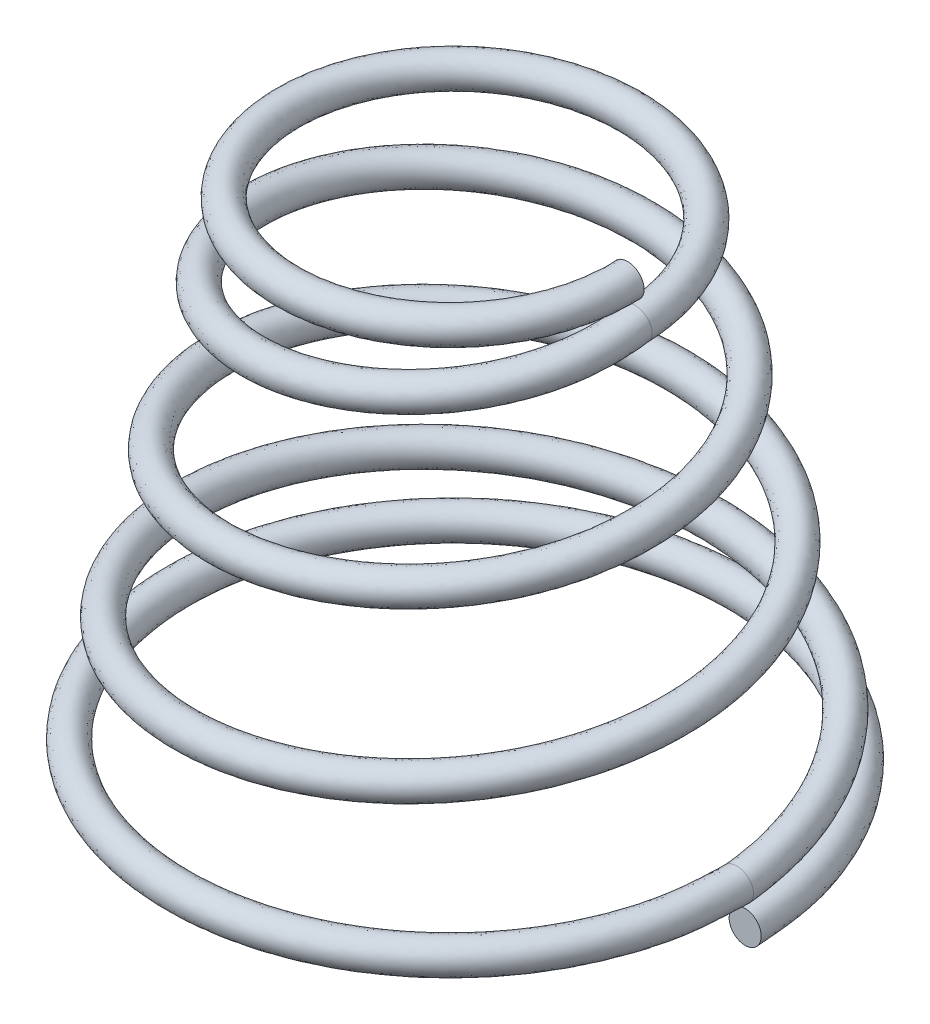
ISO-10303-21;
HEADER;
FILE_DESCRIPTION(('STEP AP214'),'2;1');
FILE_NAME('part.step','',(''),(''),'','','');
FILE_SCHEMA(('AUTOMOTIVE_DESIGN { 1 0 10303 214 1 1 1 1 }'));
ENDSEC;
DATA;
#1=APPLICATION_CONTEXT('core data for automotive mechanical design processes');
#2=APPLICATION_PROTOCOL_DEFINITION('international standard','automotive_design',2000,#1);
#3=PRODUCT_CONTEXT('',#1,'mechanical');
#4=PRODUCT('Part','Part','',(#3));
#5=PRODUCT_RELATED_PRODUCT_CATEGORY('part','',(#4));
#6=PRODUCT_DEFINITION_FORMATION('','',#4);
#7=PRODUCT_DEFINITION_CONTEXT('part definition',#1,'design');
#8=PRODUCT_DEFINITION('design','',#6,#7);
#9=PRODUCT_DEFINITION_SHAPE('','',#8);
#10=(LENGTH_UNIT() NAMED_UNIT(*) SI_UNIT(.MILLI.,.METRE.));
#11=(NAMED_UNIT(*) PLANE_ANGLE_UNIT() SI_UNIT($,.RADIAN.));
#12=(NAMED_UNIT(*) SI_UNIT($,.STERADIAN.) SOLID_ANGLE_UNIT());
#13=UNCERTAINTY_MEASURE_WITH_UNIT(LENGTH_MEASURE(1.E-05),#10,'distance_accuracy_value','');
#14=(GEOMETRIC_REPRESENTATION_CONTEXT(3) GLOBAL_UNCERTAINTY_ASSIGNED_CONTEXT((#13)) GLOBAL_UNIT_ASSIGNED_CONTEXT((#10,
#11,#12)) REPRESENTATION_CONTEXT('',''));
#15=CARTESIAN_POINT('',(0.,0.,0.));
#16=DIRECTION('',(0.,0.,1.));
#17=DIRECTION('',(1.,0.,0.));
#18=AXIS2_PLACEMENT_3D('',#15,#16,#17);
#19=CARTESIAN_POINT('',(10.66165,0.571500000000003,0.));
#20=CARTESIAN_POINT('',(10.6187580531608,0.583946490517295,-0.697260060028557));
#21=CARTESIAN_POINT('',(10.5330105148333,0.608828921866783,-2.09118918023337));
#22=CARTESIAN_POINT('',(9.89311038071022,0.646074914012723,-4.09954337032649));
#23=CARTESIAN_POINT('',(8.90062286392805,0.683448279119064,-5.94592699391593));
#24=CARTESIAN_POINT('',(7.56304328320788,0.72068515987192,-7.56294186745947));
#25=CARTESIAN_POINT('',(5.93682870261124,0.758061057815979,-8.88436383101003));
#26=CARTESIAN_POINT('',(4.08672098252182,0.795297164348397,-9.86544840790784));
#27=CARTESIAN_POINT('',(2.08151259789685,0.832673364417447,-10.4627889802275));
#28=CARTESIAN_POINT('',(0.000311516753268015,0.869909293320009,-10.6608932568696));
#29=CARTESIAN_POINT('',(-2.07746125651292,0.907285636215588,-10.4457304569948));
#30=CARTESIAN_POINT('',(-4.07275619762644,0.944521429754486,-9.83331032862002));
#31=CARTESIAN_POINT('',(-5.90700255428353,0.98189790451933,-8.84101687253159));
#32=CARTESIAN_POINT('',(-7.51339350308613,1.01913356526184,-7.51382426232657));
#33=CARTESIAN_POINT('',(-8.82610482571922,1.05651017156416,-5.89778545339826));
#34=CARTESIAN_POINT('',(-9.80069921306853,1.0937456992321,-4.0599074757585));
#35=CARTESIAN_POINT('',(-10.3940601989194,1.13112243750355,-2.0678169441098));
#36=CARTESIAN_POINT('',(-10.5908018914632,1.16835783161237,-0.000295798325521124));
#37=CARTESIAN_POINT('',(-10.3769948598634,1.20573470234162,2.06380729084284));
#38=CARTESIAN_POINT('',(-9.76854760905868,1.24296996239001,4.04594952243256));
#39=CARTESIAN_POINT('',(-8.78273875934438,1.28034696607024,5.86808359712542));
#40=CARTESIAN_POINT('',(-7.4642496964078,1.31758209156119,7.463843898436));
#41=CARTESIAN_POINT('',(-5.85883706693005,1.35495922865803,8.76784633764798));
#42=CARTESIAN_POINT('',(-4.03306842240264,1.39219421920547,9.73595000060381));
#43=CARTESIAN_POINT('',(-2.05412737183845,1.42957148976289,10.325331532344));
#44=CARTESIAN_POINT('',(-0.000279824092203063,1.46680634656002,10.5207103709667));
#45=CARTESIAN_POINT('',(2.05015984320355,1.50418374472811,10.3082597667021));
#46=CARTESIAN_POINT('',(4.01911800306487,1.54141849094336,9.7037827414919));
#47=CARTESIAN_POINT('',(5.82925875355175,1.57879592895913,8.72446815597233));
#48=CARTESIAN_POINT('',(7.41394434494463,1.61603089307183,7.41464644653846));
#49=CARTESIAN_POINT('',(8.71089298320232,1.65340714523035,5.81999472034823));
#50=CARTESIAN_POINT('',(9.66633694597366,1.69064689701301,4.00583313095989));
#51=CARTESIAN_POINT('',(10.2748329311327,1.72801116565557,2.04158568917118));
#52=CARTESIAN_POINT('',(10.3470126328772,1.75290038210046,0.675860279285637));
#53=CARTESIAN_POINT('',(10.3830958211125,1.76534269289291,-0.00687636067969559));
#54=CARTESIAN_POINT('',(10.66165,1.71450000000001,0.));
#55=CARTESIAN_POINT('',(10.6187330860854,1.72694648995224,-0.697247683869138));
#56=CARTESIAN_POINT('',(10.5329356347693,1.75182892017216,-2.09115206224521));
#57=CARTESIAN_POINT('',(9.89316214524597,1.78907491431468,-4.09952608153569));
#58=CARTESIAN_POINT('',(8.90057919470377,1.82644827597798,-5.94582854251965));
#59=CARTESIAN_POINT('',(7.56312737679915,1.86368515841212,-7.56292083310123));
#60=CARTESIAN_POINT('',(5.93685683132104,1.90106105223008,-8.88423527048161));
#61=CARTESIAN_POINT('',(4.08684197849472,1.93829715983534,-9.86544743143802));
#62=CARTESIAN_POINT('',(2.0816248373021,1.97567335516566,-10.4626739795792));
#63=CARTESIAN_POINT('',(0.000461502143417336,2.01290928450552,-10.6609393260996));
#64=CARTESIAN_POINT('',(-2.07727648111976,2.05028562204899,-10.4456749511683));
#65=CARTESIAN_POINT('',(-4.07260045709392,2.08752141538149,-9.83342542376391));
#66=CARTESIAN_POINT('',(-5.90677922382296,2.12489788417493,-8.84105776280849));
#67=CARTESIAN_POINT('',(-7.5132672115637,2.16213354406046,-7.51401759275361));
#68=CARTESIAN_POINT('',(-8.82589329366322,2.19951014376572,-5.89794064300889));
#69=CARTESIAN_POINT('',(-9.80064251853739,2.23674566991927,-4.06016997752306));
#70=CARTESIAN_POINT('',(-10.3939170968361,2.27412240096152,-2.0680788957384));
#71=CARTESIAN_POINT('',(-10.5908506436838,2.31135779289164,-0.000598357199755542));
#72=CARTESIAN_POINT('',(-10.3769707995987,2.34873465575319,2.06347292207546));
#73=CARTESIAN_POINT('',(-9.76872378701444,2.38596991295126,4.04565336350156));
#74=CARTESIAN_POINT('',(-8.78286625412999,2.42334690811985,5.86773365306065));
#75=CARTESIAN_POINT('',(-7.46455358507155,2.4605820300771,7.46361089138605));
#76=CARTESIAN_POINT('',(-5.85912117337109,2.49795915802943,8.76755065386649));
#77=CARTESIAN_POINT('',(-4.03347441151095,2.53519414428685,9.73583693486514));
#78=CARTESIAN_POINT('',(-2.05454115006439,2.57257140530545,10.3251595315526));
#79=CARTESIAN_POINT('',(-0.000737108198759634,2.60980625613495,10.520763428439));
#80=CARTESIAN_POINT('',(2.04967378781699,2.64718364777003,10.3082617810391));
#81=CARTESIAN_POINT('',(4.01867940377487,2.68441837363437,9.70404262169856));
#82=CARTESIAN_POINT('',(5.82878059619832,2.72179585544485,8.72460246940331));
#83=CARTESIAN_POINT('',(7.41360246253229,2.75903060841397,7.4153644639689));
#84=CARTESIAN_POINT('',(8.71051445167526,2.79640761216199,5.81928401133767));
#85=CARTESIAN_POINT('',(9.66615748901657,2.83364451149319,4.01057982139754));
#86=CARTESIAN_POINT('',(10.274666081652,2.8710193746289,2.026514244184));
#87=CARTESIAN_POINT('',(10.346909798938,2.89588220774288,0.710145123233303));
#88=CARTESIAN_POINT('',(10.3830249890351,2.90831132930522,0.0520820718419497));
#89=CARTESIAN_POINT('',(9.51865000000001,1.71450000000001,0.));
#90=CARTESIAN_POINT('',(9.47998320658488,1.72691991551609,-0.622451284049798));
#91=CARTESIAN_POINT('',(9.40268239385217,1.75174921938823,-1.86682626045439));
#92=CARTESIAN_POINT('',(8.83085398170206,1.78911838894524,-3.65937860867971));
#93=CARTESIAN_POINT('',(7.94389488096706,1.82635752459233,-5.30678900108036));
#94=CARTESIAN_POINT('',(6.74967546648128,1.86373235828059,-6.74954392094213));
#95=CARTESIAN_POINT('',(5.29767330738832,1.90096988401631,-7.92778117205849));
#96=CARTESIAN_POINT('',(3.64655200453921,1.93834524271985,-8.80267296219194));
#97=CARTESIAN_POINT('',(1.8571325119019,1.97558253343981,-9.33442281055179));
#98=CARTESIAN_POINT('',(0.000399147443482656,2.01295804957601,-9.5105710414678));
#99=CARTESIAN_POINT('',(-1.85290818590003,2.05019520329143,-9.31739926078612));
#100=CARTESIAN_POINT('',(-3.63242330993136,2.08757085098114,-8.77060310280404));
#101=CARTESIAN_POINT('',(-5.26771024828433,2.12480787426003,-7.88453383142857));
#102=CARTESIAN_POINT('',(-6.69986589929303,2.16218365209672,-6.70055247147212));
#103=CARTESIAN_POINT('',(-7.86941982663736,2.19942054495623,-5.25879613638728));
#104=CARTESIAN_POINT('',(-8.7378547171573,2.23679645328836,-3.61990949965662));
#105=CARTESIAN_POINT('',(-9.26565911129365,2.27403321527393,-1.84362151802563));
#106=CARTESIAN_POINT('',(-9.4404823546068,2.31140925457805,-0.000570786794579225));
#107=CARTESIAN_POINT('',(-9.24870193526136,2.34864588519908,1.83907022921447));
#108=CARTESIAN_POINT('',(-8.70591489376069,2.38602205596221,3.60544379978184));
#109=CARTESIAN_POINT('',(-7.82636184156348,2.42325855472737,5.22863545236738));
#110=CARTESIAN_POINT('',(-6.65111336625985,2.46063485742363,6.65018467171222));
#111=CARTESIAN_POINT('',(-5.22000598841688,2.49787122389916,7.81105758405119));
#112=CARTESIAN_POINT('',(-3.59324657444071,2.53524765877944,8.67303562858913));
#113=CARTESIAN_POINT('',(-1.83011853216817,2.5724838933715,9.1968945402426));
#114=CARTESIAN_POINT('',(-0.00074481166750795,2.60986045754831,9.37039549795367));
#115=CARTESIAN_POINT('',(1.82523552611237,2.64709657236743,9.17999848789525));
#116=CARTESIAN_POINT('',(3.57843970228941,2.6844732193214,8.64125238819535));
#117=CARTESIAN_POINT('',(5.18964250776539,2.72170938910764,7.76809906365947));
#118=CARTESIAN_POINT('',(6.6001891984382,2.75908546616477,6.6020195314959));
#119=CARTESIAN_POINT('',(7.75385906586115,2.79632412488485,5.17993755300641));
#120=CARTESIAN_POINT('',(8.60387337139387,2.83369055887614,3.57135792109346));
#121=CARTESIAN_POINT('',(9.1444039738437,2.8709717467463,1.79853627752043));
#122=CARTESIAN_POINT('',(9.20815636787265,2.89580940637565,0.643330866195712));
#123=CARTESIAN_POINT('',(9.24002668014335,2.90822594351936,0.0658347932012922));
#124=CARTESIAN_POINT('',(9.51864999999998,0.571500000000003,0.));
#125=CARTESIAN_POINT('',(9.48000817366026,0.583919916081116,-0.622463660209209));
#126=CARTESIAN_POINT('',(9.40275727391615,0.608749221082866,-1.86686337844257));
#127=CARTESIAN_POINT('',(8.8308022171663,0.646118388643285,-3.65939589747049));
#128=CARTESIAN_POINT('',(7.94393855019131,0.68335752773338,-5.30688745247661));
#129=CARTESIAN_POINT('',(6.74959137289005,0.72073235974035,-6.74956495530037));
#130=CARTESIAN_POINT('',(5.29764517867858,0.757969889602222,-7.92790973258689));
#131=CARTESIAN_POINT('',(3.64643100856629,0.795345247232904,-8.80267393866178));
#132=CARTESIAN_POINT('',(1.85702027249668,0.832582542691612,-9.33453781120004));
#133=CARTESIAN_POINT('',(0.000249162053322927,0.869958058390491,-9.51052497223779));
#134=CARTESIAN_POINT('',(-1.8530929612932,0.907195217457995,-9.31745476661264));
#135=CARTESIAN_POINT('',(-3.63257905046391,0.944570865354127,-8.77048800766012));
#136=CARTESIAN_POINT('',(-5.26793357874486,0.98180789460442,-7.88449294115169));
#137=CARTESIAN_POINT('',(-6.69999219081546,1.01918367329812,-6.70035914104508));
#138=CARTESIAN_POINT('',(-7.8696313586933,1.05642057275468,-5.25864094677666));
#139=CARTESIAN_POINT('',(-8.73791141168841,1.09379648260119,-3.61964699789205));
#140=CARTESIAN_POINT('',(-9.26580221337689,1.13103325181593,-1.84335956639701));
#141=CARTESIAN_POINT('',(-9.4404336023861,1.16840929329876,-0.000268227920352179));
#142=CARTESIAN_POINT('',(-9.24872599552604,1.20564593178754,1.83940459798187));
#143=CARTESIAN_POINT('',(-8.70573871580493,1.24302210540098,3.60573995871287));
#144=CARTESIAN_POINT('',(-7.82623434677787,1.28025861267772,5.22898539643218));
#145=CARTESIAN_POINT('',(-6.65080947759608,1.31763491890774,6.65041767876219));
#146=CARTESIAN_POINT('',(-5.21972188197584,1.35487129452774,7.81135326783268));
#147=CARTESIAN_POINT('',(-3.59284058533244,1.39224773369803,8.67314869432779));
#148=CARTESIAN_POINT('',(-1.8297047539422,1.42948397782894,9.19706654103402));
#149=CARTESIAN_POINT('',(-0.000287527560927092,1.46686054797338,9.37034244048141));
#150=CARTESIAN_POINT('',(1.82572158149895,1.50409666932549,9.1799964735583));
#151=CARTESIAN_POINT('',(3.57887830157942,1.54147333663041,8.64099250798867));
#152=CARTESIAN_POINT('',(5.19012066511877,1.5787094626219,7.76796475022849));
#153=CARTESIAN_POINT('',(6.60053108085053,1.61608575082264,6.60130151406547));
#154=CARTESIAN_POINT('',(7.75423759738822,1.6533236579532,5.18064826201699));
#155=CARTESIAN_POINT('',(8.60405282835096,1.69069294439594,3.56661123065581));
#156=CARTESIAN_POINT('',(9.14457082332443,1.72796353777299,1.81360772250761));
#157=CARTESIAN_POINT('',(9.20825920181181,1.75282758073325,0.609046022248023));
#158=CARTESIAN_POINT('',(9.24009751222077,1.76525730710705,0.00687636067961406));
#159=CARTESIAN_POINT('',(9.51865000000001,-0.571499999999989,0.));
#160=CARTESIAN_POINT('',(9.48003314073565,-0.559080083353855,-0.622476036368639));
#161=CARTESIAN_POINT('',(9.40283215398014,-0.534250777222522,-1.86690049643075));
#162=CARTESIAN_POINT('',(8.83075045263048,-0.496881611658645,-3.65941318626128));
#163=CARTESIAN_POINT('',(7.94398221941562,-0.459642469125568,-5.30698590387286));
#164=CARTESIAN_POINT('',(6.74950727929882,-0.422267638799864,-6.74958598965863));
#165=CARTESIAN_POINT('',(5.29761704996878,-0.385030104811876,-7.9280382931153));
#166=CARTESIAN_POINT('',(3.64631001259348,-0.347654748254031,-8.80267491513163));
#167=CARTESIAN_POINT('',(1.85690803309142,-0.310417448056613,-9.33465281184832));
#168=CARTESIAN_POINT('',(9.91766631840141E-05,-0.27304193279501,-9.5104789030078));
#169=CARTESIAN_POINT('',(-1.85327773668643,-0.235804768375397,-9.31751027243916));
#170=CARTESIAN_POINT('',(-3.63273479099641,-0.198429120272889,-8.77037291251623));
#171=CARTESIAN_POINT('',(-5.26815690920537,-0.161192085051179,-7.88445205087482));
#172=CARTESIAN_POINT('',(-6.70011848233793,-0.123816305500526,-6.70016581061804));
#173=CARTESIAN_POINT('',(-7.86984289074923,-0.0865793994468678,-5.25848575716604));
#174=CARTESIAN_POINT('',(-8.7379681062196,-0.049203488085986,-3.6193844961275));
#175=CARTESIAN_POINT('',(-9.26594531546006,-0.0119667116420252,-1.84309761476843));
#176=CARTESIAN_POINT('',(-9.4403848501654,0.0254093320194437,3.4330953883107E-05));
#177=CARTESIAN_POINT('',(-9.24875005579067,0.0626459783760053,1.83973896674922));
#178=CARTESIAN_POINT('',(-8.70556253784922,0.100022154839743,3.60603611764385));
#179=CARTESIAN_POINT('',(-7.82610685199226,0.137258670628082,5.22933534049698));
#180=CARTESIAN_POINT('',(-6.6505055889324,0.174634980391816,6.65065068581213));
#181=CARTESIAN_POINT('',(-5.21943777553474,0.211871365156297,7.81164895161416));
#182=CARTESIAN_POINT('',(-3.59243459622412,0.249247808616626,8.67326176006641));
#183=CARTESIAN_POINT('',(-1.82929097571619,0.286484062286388,9.19723854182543));
#184=CARTESIAN_POINT('',(0.000169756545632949,0.323860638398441,9.37028938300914));
#185=CARTESIAN_POINT('',(1.82620763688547,0.36109676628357,9.17999445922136));
#186=CARTESIAN_POINT('',(3.57931690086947,0.398473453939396,8.64073262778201));
#187=CARTESIAN_POINT('',(5.19059882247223,0.435709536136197,7.76783043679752));
#188=CARTESIAN_POINT('',(6.60087296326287,0.473086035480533,6.60058349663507));
#189=CARTESIAN_POINT('',(7.75461612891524,0.510323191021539,5.18135897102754));
#190=CARTESIAN_POINT('',(8.60423228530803,0.547695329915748,3.56186454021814));
#191=CARTESIAN_POINT('',(9.14473767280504,0.584955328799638,1.82867916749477));
#192=CARTESIAN_POINT('',(9.20836203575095,0.609845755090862,0.574761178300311));
#193=CARTESIAN_POINT('',(9.24016834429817,0.622288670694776,-0.0520820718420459));
#194=CARTESIAN_POINT('',(10.66165,-0.571499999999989,0.));
#195=CARTESIAN_POINT('',(10.6187830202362,-0.559053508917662,-0.697272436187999));
#196=CARTESIAN_POINT('',(10.5330853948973,-0.534171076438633,-2.09122629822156));
#197=CARTESIAN_POINT('',(9.89305861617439,-0.496925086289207,-4.09956065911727));
#198=CARTESIAN_POINT('',(8.90066653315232,-0.45955171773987,-5.94602544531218));
#199=CARTESIAN_POINT('',(7.56295918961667,-0.422314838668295,-7.56296290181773));
#200=CARTESIAN_POINT('',(5.9368005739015,-0.384938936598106,-8.88449239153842));
#201=CARTESIAN_POINT('',(4.08659998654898,-0.347702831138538,-9.86544938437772));
#202=CARTESIAN_POINT('',(2.08140035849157,-0.310326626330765,-10.4629039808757));
#203=CARTESIAN_POINT('',(0.000161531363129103,-0.273090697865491,-10.6608471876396));
#204=CARTESIAN_POINT('',(-2.07764603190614,-0.235714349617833,-10.4457859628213));
#205=CARTESIAN_POINT('',(-4.07291193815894,-0.198478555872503,-9.83319523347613));
#206=CARTESIAN_POINT('',(-5.90722588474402,-0.161102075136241,-8.84097598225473));
#207=CARTESIAN_POINT('',(-7.5135197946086,-0.123866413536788,-7.51363093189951));
#208=CARTESIAN_POINT('',(-8.82631635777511,-0.086489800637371,-5.89763026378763));
#209=CARTESIAN_POINT('',(-9.80075590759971,-0.0492542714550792,-4.05964497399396));
#210=CARTESIAN_POINT('',(-10.3942033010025,-0.0118775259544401,-2.0675549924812));
#211=CARTESIAN_POINT('',(-10.5907531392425,0.0253578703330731,6.76054872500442E-06));
#212=CARTESIAN_POINT('',(-10.377018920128,0.0627347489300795,2.06414165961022));
#213=CARTESIAN_POINT('',(-9.76837143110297,0.0999700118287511,4.04624568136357));
#214=CARTESIAN_POINT('',(-8.78261126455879,0.137347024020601,5.8684335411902));
#215=CARTESIAN_POINT('',(-7.46394580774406,0.174582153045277,7.46407690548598));
#216=CARTESIAN_POINT('',(-5.85855296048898,0.211959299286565,8.76814202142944));
#217=CARTESIAN_POINT('',(-4.03266243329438,0.249194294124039,9.73606306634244));
#218=CARTESIAN_POINT('',(-2.05371359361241,0.286571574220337,10.3255035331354));
#219=CARTESIAN_POINT('',(0.000177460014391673,0.323806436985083,10.5206573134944));
#220=CARTESIAN_POINT('',(2.05064589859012,0.361183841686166,10.3082577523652));
#221=CARTESIAN_POINT('',(4.01955660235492,0.398418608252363,9.70352286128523));
#222=CARTESIAN_POINT('',(5.82973691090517,0.435796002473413,8.72433384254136));
#223=CARTESIAN_POINT('',(7.41428622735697,0.473031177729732,7.41392842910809));
#224=CARTESIAN_POINT('',(8.71127151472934,0.510406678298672,5.8207054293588));
#225=CARTESIAN_POINT('',(9.66651640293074,0.547649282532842,4.00108644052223));
#226=CARTESIAN_POINT('',(10.2749997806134,0.585002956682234,2.05665713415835));
#227=CARTESIAN_POINT('',(10.3471154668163,0.609918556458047,0.641575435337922));
#228=CARTESIAN_POINT('',(10.38316665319,0.622374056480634,-0.0658347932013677));
#229=CARTESIAN_POINT('',(10.66165,0.571500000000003,0.));
#230=CARTESIAN_POINT('',(10.6187580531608,0.583946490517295,-0.697260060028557));
#231=CARTESIAN_POINT('',(10.5330105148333,0.608828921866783,-2.09118918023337));
#232=CARTESIAN_POINT('',(9.89311038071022,0.646074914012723,-4.09954337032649));
#233=CARTESIAN_POINT('',(8.90062286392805,0.683448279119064,-5.94592699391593));
#234=CARTESIAN_POINT('',(7.56304328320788,0.72068515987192,-7.56294186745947));
#235=CARTESIAN_POINT('',(5.93682870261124,0.758061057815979,-8.88436383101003));
#236=CARTESIAN_POINT('',(4.08672098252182,0.795297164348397,-9.86544840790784));
#237=CARTESIAN_POINT('',(2.08151259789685,0.832673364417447,-10.4627889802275));
#238=CARTESIAN_POINT('',(0.000311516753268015,0.869909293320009,-10.6608932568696));
#239=CARTESIAN_POINT('',(-2.07746125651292,0.907285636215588,-10.4457304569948));
#240=CARTESIAN_POINT('',(-4.07275619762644,0.944521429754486,-9.83331032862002));
#241=CARTESIAN_POINT('',(-5.90700255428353,0.98189790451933,-8.84101687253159));
#242=CARTESIAN_POINT('',(-7.51339350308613,1.01913356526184,-7.51382426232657));
#243=CARTESIAN_POINT('',(-8.82610482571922,1.05651017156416,-5.89778545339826));
#244=CARTESIAN_POINT('',(-9.80069921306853,1.0937456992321,-4.0599074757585));
#245=CARTESIAN_POINT('',(-10.3940601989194,1.13112243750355,-2.0678169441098));
#246=CARTESIAN_POINT('',(-10.5908018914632,1.16835783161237,-0.000295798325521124));
#247=CARTESIAN_POINT('',(-10.3769948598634,1.20573470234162,2.06380729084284));
#248=CARTESIAN_POINT('',(-9.76854760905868,1.24296996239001,4.04594952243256));
#249=CARTESIAN_POINT('',(-8.78273875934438,1.28034696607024,5.86808359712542));
#250=CARTESIAN_POINT('',(-7.4642496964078,1.31758209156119,7.463843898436));
#251=CARTESIAN_POINT('',(-5.85883706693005,1.35495922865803,8.76784633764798));
#252=CARTESIAN_POINT('',(-4.03306842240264,1.39219421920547,9.73595000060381));
#253=CARTESIAN_POINT('',(-2.05412737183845,1.42957148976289,10.325331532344));
#254=CARTESIAN_POINT('',(-0.000279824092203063,1.46680634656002,10.5207103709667));
#255=CARTESIAN_POINT('',(2.05015984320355,1.50418374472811,10.3082597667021));
#256=CARTESIAN_POINT('',(4.01911800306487,1.54141849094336,9.7037827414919));
#257=CARTESIAN_POINT('',(5.82925875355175,1.57879592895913,8.72446815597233));
#258=CARTESIAN_POINT('',(7.41394434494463,1.61603089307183,7.41464644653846));
#259=CARTESIAN_POINT('',(8.71089298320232,1.65340714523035,5.81999472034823));
#260=CARTESIAN_POINT('',(9.66633694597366,1.69064689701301,4.00583313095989));
#261=CARTESIAN_POINT('',(10.2748329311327,1.72801116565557,2.04158568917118));
#262=CARTESIAN_POINT('',(10.3470126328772,1.75290038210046,0.675860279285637));
#263=CARTESIAN_POINT('',(10.3830958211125,1.76534269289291,-0.00687636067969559));
#264=(BOUNDED_SURFACE() B_SPLINE_SURFACE(3,3,((#19,#20,#21,#22,#23,#24,#25,#26,#27,#28,#29,#30,
#31,#32,#33,#34,#35,#36,#37,#38,#39,#40,#41,#42,#43,#44,#45,#46,#47,#48,#49,#50,#51,#52,#53),
(#54,#55,#56,#57,#58,#59,#60,#61,#62,#63,#64,#65,#66,#67,#68,#69,#70,#71,#72,#73,#74,#75,#76,
#77,#78,#79,#80,#81,#82,#83,#84,#85,#86,#87,#88),(#89,#90,#91,#92,#93,#94,#95,#96,#97,#98,#99,
#100,#101,#102,#103,#104,#105,#106,#107,#108,#109,#110,#111,#112,#113,#114,#115,#116,#117,#118,
#119,#120,#121,#122,#123),(#124,#125,#126,#127,#128,#129,#130,#131,#132,#133,#134,#135,#136,
#137,#138,#139,#140,#141,#142,#143,#144,#145,#146,#147,#148,#149,#150,#151,#152,#153,#154,#155,
#156,#157,#158),(#159,#160,#161,#162,#163,#164,#165,#166,#167,#168,#169,#170,#171,#172,#173,
#174,#175,#176,#177,#178,#179,#180,#181,#182,#183,#184,#185,#186,#187,#188,#189,#190,#191,#192,
#193),(#194,#195,#196,#197,#198,#199,#200,#201,#202,#203,#204,#205,#206,#207,#208,#209,#210,
#211,#212,#213,#214,#215,#216,#217,#218,#219,#220,#221,#222,#223,#224,#225,#226,#227,#228),
(#229,#230,#231,#232,#233,#234,#235,#236,#237,#238,#239,#240,#241,#242,#243,#244,#245,#246,#247,
#248,#249,#250,#251,#252,#253,#254,#255,#256,#257,#258,#259,#260,#261,#262,#263)),.UNSPECIFIED.,
.T.,.F.,.F.) B_SPLINE_SURFACE_WITH_KNOTS((4,3,4),(4,1,1,1,1,1,1,1,1,1,1,1,1,1,1,1,1,1,1,1,1,1,1,
1,1,1,1,1,1,1,1,1,4),(0.,0.5,1.),(0.,0.0316694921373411,0.0633121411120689,0.0949274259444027,
0.126515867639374,0.158076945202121,0.189611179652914,0.221118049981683,0.252598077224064,
0.284050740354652,0.315476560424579,0.346875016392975,0.378246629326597,0.40959087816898,
0.440908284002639,0.472198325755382,0.503461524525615,0.534697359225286,0.565906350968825,
0.597087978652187,0.628242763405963,0.659370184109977,0.690470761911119,0.721543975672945,
0.752590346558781,0.783609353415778,0.81460151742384,0.84556631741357,0.876504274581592,
0.90741486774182,0.938298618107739,0.969155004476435,1.),
.UNSPECIFIED.) GEOMETRIC_REPRESENTATION_ITEM() RATIONAL_B_SPLINE_SURFACE(((1.,1.,1.,1.,1.,1.,1.,
1.,1.,1.,1.,1.,1.,1.,1.,1.,1.,1.,1.,1.,1.,1.,1.,1.,1.,1.,1.,1.,1.,1.,1.,1.,1.,1.,1.),
(0.333333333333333,0.333333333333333,0.333333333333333,0.333333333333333,0.333333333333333,
0.333333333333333,0.333333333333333,0.333333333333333,0.333333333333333,0.333333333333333,
0.333333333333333,0.333333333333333,0.333333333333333,0.333333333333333,0.333333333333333,
0.333333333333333,0.333333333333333,0.333333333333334,0.333333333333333,0.333333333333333,
0.333333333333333,0.333333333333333,0.333333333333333,0.333333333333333,0.333333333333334,
0.333333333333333,0.333333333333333,0.333333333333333,0.333333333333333,0.333333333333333,
0.333333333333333,0.333333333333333,0.333333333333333,0.333333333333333,0.333333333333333),
(0.333333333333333,0.333333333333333,0.333333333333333,0.333333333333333,0.333333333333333,
0.333333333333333,0.333333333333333,0.333333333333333,0.333333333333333,0.333333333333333,
0.333333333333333,0.333333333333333,0.333333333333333,0.333333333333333,0.333333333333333,
0.333333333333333,0.333333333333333,0.333333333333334,0.333333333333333,0.333333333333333,
0.333333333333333,0.333333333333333,0.333333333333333,0.333333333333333,0.333333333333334,
0.333333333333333,0.333333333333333,0.333333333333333,0.333333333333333,0.333333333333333,
0.333333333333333,0.333333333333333,0.333333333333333,0.333333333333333,0.333333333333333),(1.,
1.,1.,1.,1.,1.,1.,1.,1.,1.,1.,1.,1.,1.,1.,1.,1.,1.,1.,1.,1.,1.,1.,1.,1.,1.,1.,1.,1.,1.,1.,1.,1.,
1.,1.),(0.333333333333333,0.333333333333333,0.333333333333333,0.333333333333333,
0.333333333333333,0.333333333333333,0.333333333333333,0.333333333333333,0.333333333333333,
0.333333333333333,0.333333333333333,0.333333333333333,0.333333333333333,0.333333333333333,
0.333333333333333,0.333333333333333,0.333333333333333,0.333333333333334,0.333333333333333,
0.333333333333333,0.333333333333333,0.333333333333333,0.333333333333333,0.333333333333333,
0.333333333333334,0.333333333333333,0.333333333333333,0.333333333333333,0.333333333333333,
0.333333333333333,0.333333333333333,0.333333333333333,0.333333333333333,0.333333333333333,
0.333333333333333),(0.333333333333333,0.333333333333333,0.333333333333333,0.333333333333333,
0.333333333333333,0.333333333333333,0.333333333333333,0.333333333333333,0.333333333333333,
0.333333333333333,0.333333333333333,0.333333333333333,0.333333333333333,0.333333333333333,
0.333333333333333,0.333333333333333,0.333333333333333,0.333333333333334,0.333333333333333,
0.333333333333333,0.333333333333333,0.333333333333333,0.333333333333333,0.333333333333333,
0.333333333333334,0.333333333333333,0.333333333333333,0.333333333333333,0.333333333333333,
0.333333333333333,0.333333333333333,0.333333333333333,0.333333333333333,0.333333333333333,
0.333333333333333),(1.,1.,1.,1.,1.,1.,1.,1.,1.,1.,1.,1.,1.,1.,1.,1.,1.,1.,1.,1.,1.,1.,1.,1.,1.,
1.,1.,1.,1.,1.,1.,1.,1.,1.,1.))) REPRESENTATION_ITEM('') SURFACE());
#265=CARTESIAN_POINT('',(10.09015,0.571500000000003,0.));
#266=DIRECTION('',(0.,0.,1.));
#267=DIRECTION('',(1.,0.,0.));
#268=AXIS2_PLACEMENT_3D('',#265,#266,#267);
#269=CIRCLE('',#268,0.571499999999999);
#270=CARTESIAN_POINT('',(10.66165,0.571500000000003,0.));
#271=VERTEX_POINT('',#270);
#272=EDGE_CURVE('E11',#271,#271,#269,.T.);
#273=CARTESIAN_POINT('',(10.3830958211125,1.76534269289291,-0.00687636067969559));
#274=CARTESIAN_POINT('',(10.3830249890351,2.90831132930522,0.0520820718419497));
#275=CARTESIAN_POINT('',(9.24002668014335,2.90822594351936,0.0658347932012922));
#276=CARTESIAN_POINT('',(9.24009751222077,1.76525730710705,0.00687636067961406));
#277=CARTESIAN_POINT('',(9.24016834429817,0.622288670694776,-0.0520820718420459));
#278=CARTESIAN_POINT('',(10.38316665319,0.622374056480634,-0.0658347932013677));
#279=CARTESIAN_POINT('',(10.3830958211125,1.76534269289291,-0.00687636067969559));
#280=(BOUNDED_CURVE() B_SPLINE_CURVE(3,(#273,#274,#275,#276,#277,#278,#279),.UNSPECIFIED.,.T.,
.F.) B_SPLINE_CURVE_WITH_KNOTS((4,3,4),(0.,0.5,1.),
.UNSPECIFIED.) CURVE() GEOMETRIC_REPRESENTATION_ITEM() RATIONAL_B_SPLINE_CURVE((1.,
0.333333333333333,0.333333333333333,1.,0.333333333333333,0.333333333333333,1.)) REPRESENTATION_ITEM(''));
#281=CARTESIAN_POINT('',(10.3830958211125,1.76534269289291,-0.00687636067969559));
#282=VERTEX_POINT('',#281);
#283=EDGE_CURVE('E66',#282,#282,#280,.F.);
#284=ORIENTED_EDGE('',*,*,#272,.F.);
#285=EDGE_LOOP('',(#284));
#286=FACE_BOUND('',#285,.T.);
#287=ORIENTED_EDGE('',*,*,#283,.F.);
#288=EDGE_LOOP('',(#287));
#289=FACE_BOUND('',#288,.T.);
#290=ADVANCED_FACE('F57',(#286,#289),#264,.F.);
#291=CARTESIAN_POINT('',(10.09015,0.571500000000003,0.));
#292=DIRECTION('',(0.,0.,1.));
#293=DIRECTION('',(1.,0.,0.));
#294=AXIS2_PLACEMENT_3D('',#291,#292,#293);
#295=PLANE('',#294);
#296=ORIENTED_EDGE('',*,*,#272,.T.);
#297=EDGE_LOOP('',(#296));
#298=FACE_BOUND('',#297,.T.);
#299=ADVANCED_FACE('F115',(#298),#295,.T.);
#300=CARTESIAN_POINT('',(10.3830958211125,1.76534269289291,-0.00687636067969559));
#301=CARTESIAN_POINT('',(10.3705662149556,1.81904100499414,-0.646797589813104));
#302=CARTESIAN_POINT('',(10.2096124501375,1.9272776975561,-2.06007275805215));
#303=CARTESIAN_POINT('',(9.58048684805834,2.08874617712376,-3.97400641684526));
#304=CARTESIAN_POINT('',(8.58868427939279,2.25032417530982,-5.75215220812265));
#305=CARTESIAN_POINT('',(7.27481391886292,2.41205977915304,-7.28836030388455));
#306=CARTESIAN_POINT('',(5.69169191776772,2.57375288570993,-8.53663778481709));
#307=CARTESIAN_POINT('',(3.90258581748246,2.73526437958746,-9.44802170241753));
#308=CARTESIAN_POINT('',(1.97702819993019,2.8970184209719,-9.99035346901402));
#309=CARTESIAN_POINT('',(-0.0103135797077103,3.05870708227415,-10.1461158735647));
#310=CARTESIAN_POINT('',(-1.98208859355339,3.22021741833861,-9.91219228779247));
#311=CARTESIAN_POINT('',(-3.86304412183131,3.38197250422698,-9.29977264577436));
#312=CARTESIAN_POINT('',(-5.58229833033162,3.54366135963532,-8.33568374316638));
#313=CARTESIAN_POINT('',(-7.07452933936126,3.70516922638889,-7.05986112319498));
#314=CARTESIAN_POINT('',(-8.28406264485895,3.86692572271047,-5.52289326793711));
#315=CARTESIAN_POINT('',(-9.16740224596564,4.02861468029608,-3.78579195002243));
#316=CARTESIAN_POINT('',(-9.69282675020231,4.19012002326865,-1.9173001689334));
#317=CARTESIAN_POINT('',(-9.84241011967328,4.35187796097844,0.0104065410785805));
#318=CARTESIAN_POINT('',(-9.61395794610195,4.51356702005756,1.92329009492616));
#319=CARTESIAN_POINT('',(-9.01920382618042,4.67506974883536,3.74742079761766));
#320=CARTESIAN_POINT('',(-8.08310267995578,4.83682919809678,5.4136524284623));
#321=CARTESIAN_POINT('',(-6.84455213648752,4.99851823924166,6.85995964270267));
#322=CARTESIAN_POINT('',(-5.35383063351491,5.16001869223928,8.03205133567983));
#323=CARTESIAN_POINT('',(-3.66948026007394,5.32177812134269,8.88685835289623));
#324=CARTESIAN_POINT('',(-1.85741614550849,5.48347297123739,9.39479347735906));
#325=CARTESIAN_POINT('',(0.0877947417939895,5.65160857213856,9.54492719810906));
#326=CARTESIAN_POINT('',(2.09448968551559,5.82686143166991,9.27887539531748));
#327=CARTESIAN_POINT('',(4.05837711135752,6.00868724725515,8.55567996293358));
#328=CARTESIAN_POINT('',(5.80824523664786,6.19059187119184,7.42480565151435));
#329=CARTESIAN_POINT('',(7.26089116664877,6.37229252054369,5.94480945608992));
#330=CARTESIAN_POINT('',(8.34859742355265,6.55427280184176,4.19028489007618));
#331=CARTESIAN_POINT('',(9.02231102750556,6.73610789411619,2.24866410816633));
#332=CARTESIAN_POINT('',(9.25308749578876,6.91800991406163,0.215967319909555));
#333=CARTESIAN_POINT('',(9.03376678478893,7.09970682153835,-1.80825926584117));
#334=CARTESIAN_POINT('',(8.3788755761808,7.28168938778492,-3.72614742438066));
#335=CARTESIAN_POINT('',(7.32432942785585,7.46352335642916,-5.44606841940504));
#336=CARTESIAN_POINT('',(5.92506700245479,7.64542549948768,-6.88631283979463));
#337=CARTESIAN_POINT('',(4.25225404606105,7.82711769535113,-7.9795407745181));
#338=CARTESIAN_POINT('',(2.38925341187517,8.00910284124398,-8.67594008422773));
#339=CARTESIAN_POINT('',(0.427973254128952,8.19093555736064,-8.94582259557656));
#340=CARTESIAN_POINT('',(-1.53537872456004,8.37283781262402,-8.78011142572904));
#341=CARTESIAN_POINT('',(-3.40542973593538,8.55452503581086,-8.19099165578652));
#342=CARTESIAN_POINT('',(-5.09255315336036,8.73651286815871,-7.21080267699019));
#343=CARTESIAN_POINT('',(-6.51710004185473,8.91834424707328,-5.89086716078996));
#344=CARTESIAN_POINT('',(-7.61239174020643,9.10024658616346,-4.29858399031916));
#345=CARTESIAN_POINT('',(-8.32842128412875,9.2819285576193,-2.51392612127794));
#346=CARTESIAN_POINT('',(-8.63406073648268,9.46391919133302,-0.625011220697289));
#347=CARTESIAN_POINT('',(-8.51878621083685,9.64574912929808,1.27583837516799));
#348=CARTESIAN_POINT('',(-7.99232938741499,9.82765156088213,3.09615101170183));
#349=CARTESIAN_POINT('',(-7.08432787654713,10.0093278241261,4.74830978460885));
#350=CARTESIAN_POINT('',(-5.84230428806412,10.1913219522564,6.15398144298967));
#351=CARTESIAN_POINT('',(-4.32980511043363,10.3731482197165,7.24787060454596));
#352=CARTESIAN_POINT('',(-2.62287338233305,10.5550585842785,7.97992218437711));
#353=CARTESIAN_POINT('',(-0.73228357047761,10.7441686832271,8.33223103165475));
#354=CARTESIAN_POINT('',(1.25909402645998,10.9413408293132,8.23139314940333));
#355=CARTESIAN_POINT('',(3.22619933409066,11.1458557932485,7.62428768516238));
#356=CARTESIAN_POINT('',(4.97337827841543,11.3504698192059,6.55796951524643));
#357=CARTESIAN_POINT('',(6.3960325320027,11.5550536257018,5.10301078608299));
#358=CARTESIAN_POINT('',(7.41087170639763,11.7596404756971,3.3530538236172));
#359=CARTESIAN_POINT('',(7.96051776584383,11.9641120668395,1.41872107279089));
#360=CARTESIAN_POINT('',(8.01680718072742,12.1687971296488,-0.579292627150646));
#361=CARTESIAN_POINT('',(7.58217282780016,12.3733209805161,-2.51819788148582));
#362=CARTESIAN_POINT('',(6.68909028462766,12.5779228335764,-4.27988613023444));
#363=CARTESIAN_POINT('',(5.39775583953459,12.7825104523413,-5.75862185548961));
#364=CARTESIAN_POINT('',(3.7920604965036,12.9871024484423,-6.86727102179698));
#365=CARTESIAN_POINT('',(1.97413596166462,13.1915976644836,-7.54244311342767));
#366=CARTESIAN_POINT('',(0.05801079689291,13.3962625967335,-7.74809554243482));
#367=CARTESIAN_POINT('',(-1.83803265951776,13.6007682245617,-7.47743492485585));
#368=CARTESIAN_POINT('',(-3.59817095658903,13.8053593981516,-6.75293269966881));
#369=CARTESIAN_POINT('',(-5.1162915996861,14.0099502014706,-5.62460982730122));
#370=CARTESIAN_POINT('',(-6.30247182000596,14.2145296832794,-4.16662012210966));
#371=CARTESIAN_POINT('',(-7.0882633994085,14.4191041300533,-2.47240239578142));
#372=CARTESIAN_POINT('',(-7.43063026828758,14.623536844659,-0.648728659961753));
#373=CARTESIAN_POINT('',(-7.31429221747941,14.8282489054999,1.19107164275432));
#374=CARTESIAN_POINT('',(-6.7522762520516,15.0327658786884,2.93442101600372));
#375=CARTESIAN_POINT('',(-5.78476114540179,15.2373672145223,4.47571357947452));
#376=CARTESIAN_POINT('',(-4.47627259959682,15.4419462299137,5.72322063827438));
#377=CARTESIAN_POINT('',(-2.91141143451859,15.6465272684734,6.60439404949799));
#378=CARTESIAN_POINT('',(-1.18937731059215,15.8509897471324,7.07012562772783));
#379=CARTESIAN_POINT('',(0.582182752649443,16.0556621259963,7.09737255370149));
#380=CARTESIAN_POINT('',(2.29445487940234,16.2601669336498,6.69055853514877));
#381=CARTESIAN_POINT('',(3.84332135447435,16.4647501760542,5.87962517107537));
#382=CARTESIAN_POINT('',(5.1362350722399,16.66935808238,4.72267511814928));
#383=CARTESIAN_POINT('',(6.09719612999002,16.8738375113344,3.28431935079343));
#384=CARTESIAN_POINT('',(6.67296762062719,17.0786673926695,1.69730437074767));
#385=CARTESIAN_POINT('',(6.77779423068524,17.2146006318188,0.502426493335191));
#386=CARTESIAN_POINT('',(6.76185980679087,17.2828910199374,-0.0110312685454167));
#387=CARTESIAN_POINT('',(10.38316665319,0.622374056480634,-0.0658347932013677));
#388=CARTESIAN_POINT('',(10.3728973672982,0.666385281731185,-0.590315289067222));
#389=CARTESIAN_POINT('',(10.1860367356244,0.793322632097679,-2.22508676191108));
#390=CARTESIAN_POINT('',(9.54404726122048,0.947344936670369,-4.04471322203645));
#391=CARTESIAN_POINT('',(8.53365454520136,1.11094585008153,-5.83768308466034));
#392=CARTESIAN_POINT('',(7.20539205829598,1.27218282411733,-7.35574424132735));
#393=CARTESIAN_POINT('',(5.6097433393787,1.43404994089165,-8.59104371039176));
#394=CARTESIAN_POINT('',(3.8112551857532,1.59555578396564,-9.48483824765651));
#395=CARTESIAN_POINT('',(1.87991837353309,1.75735305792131,-10.0090343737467));
#396=CARTESIAN_POINT('',(-0.10962004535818,1.9190728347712,-10.1454442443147));
#397=CARTESIAN_POINT('',(-2.07966381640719,2.08061706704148,-9.89181910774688));
#398=CARTESIAN_POINT('',(-3.95520133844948,2.24240634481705,-9.2607974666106));
#399=CARTESIAN_POINT('',(-5.66543255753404,2.40413025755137,-8.27922234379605));
#400=CARTESIAN_POINT('',(-7.14511442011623,2.56567252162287,-6.98779558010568));
#401=CARTESIAN_POINT('',(-8.33962356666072,2.72746464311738,-5.43823290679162));
#402=CARTESIAN_POINT('',(-9.20553164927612,2.88918988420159,-3.69150047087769));
#403=CARTESIAN_POINT('',(-9.71161624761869,3.05073092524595,-1.8169455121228));
#404=CARTESIAN_POINT('',(-9.84147230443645,3.2125257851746,0.112899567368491));
#405=CARTESIAN_POINT('',(-9.59293400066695,3.37425246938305,2.024073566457));
#406=CARTESIAN_POINT('',(-8.97849466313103,3.53579224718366,3.84241801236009));
#407=CARTESIAN_POINT('',(-8.02459283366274,3.69758998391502,5.49934337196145));
#408=CARTESIAN_POINT('',(-6.77010415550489,3.85931805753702,6.93290411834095));
#409=CARTESIAN_POINT('',(-5.26607569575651,4.02085697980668,8.08904272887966));
#410=CARTESIAN_POINT('',(-3.57198706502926,4.18265612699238,8.92599762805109));
#411=CARTESIAN_POINT('',(-1.75368690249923,4.3443914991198,9.41422866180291));
#412=CARTESIAN_POINT('',(0.193827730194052,4.51256866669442,9.54259202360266));
#413=CARTESIAN_POINT('',(2.19825193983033,4.68786642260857,9.25431189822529));
#414=CARTESIAN_POINT('',(4.15465549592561,4.86973898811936,8.50865681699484));
#415=CARTESIAN_POINT('',(5.89230887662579,5.05169179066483,7.35751498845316));
#416=CARTESIAN_POINT('',(7.32823666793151,5.23343992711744,5.86015370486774));
#417=CARTESIAN_POINT('',(8.39620160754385,5.41546954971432,4.09257258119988));
#418=CARTESIAN_POINT('',(9.04737154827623,5.59735417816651,2.14234827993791));
#419=CARTESIAN_POINT('',(9.25427054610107,5.77930723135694,0.106192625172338));
#420=CARTESIAN_POINT('',(9.01044985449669,5.96105451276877,-1.91606462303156));
#421=CARTESIAN_POINT('',(8.33250480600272,6.14308935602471,-3.82681490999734));
#422=CARTESIAN_POINT('',(7.25660379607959,6.32497586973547,-5.53450889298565));
#423=CARTESIAN_POINT('',(5.83918188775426,6.50693213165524,-6.95814791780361));
#424=CARTESIAN_POINT('',(4.15208829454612,6.68867782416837,-8.03076784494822));
#425=CARTESIAN_POINT('',(2.27982126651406,6.87071842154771,-8.70436049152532));
#426=CARTESIAN_POINT('',(0.314387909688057,7.05260693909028,-8.94948420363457));
#427=CARTESIAN_POINT('',(-1.64759565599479,7.23456665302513,-8.75870351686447));
#428=CARTESIAN_POINT('',(-3.51060955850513,7.41631075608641,-8.14498448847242));
#429=CARTESIAN_POINT('',(-5.18571803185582,7.59835747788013,-7.14273442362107));
#430=CARTESIAN_POINT('',(-6.59340043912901,7.78024818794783,-5.80350911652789));
#431=CARTESIAN_POINT('',(-7.66800941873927,7.96221160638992,-4.1960937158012));
#432=CARTESIAN_POINT('',(-8.36005716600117,8.14395412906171,-2.40108296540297));
#433=CARTESIAN_POINT('',(-8.64050067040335,8.32600738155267,-0.507389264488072));
#434=CARTESIAN_POINT('',(-8.49907796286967,8.50790048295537,1.39261661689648));
#435=CARTESIAN_POINT('',(-7.94728444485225,8.68986792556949,3.20637874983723));
#436=CARTESIAN_POINT('',(-7.01558367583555,8.8716087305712,4.84628583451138));
#437=CARTESIAN_POINT('',(-5.75348088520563,9.05366953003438,6.23513935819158));
#438=CARTESIAN_POINT('',(-4.22472606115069,9.23556312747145,7.30781787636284));
#439=CARTESIAN_POINT('',(-2.50657275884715,9.41754278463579,8.01559831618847));
#440=CARTESIAN_POINT('',(-0.610095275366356,9.60672458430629,8.34015989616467));
#441=CARTESIAN_POINT('',(1.38056567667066,9.8039739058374,8.21027472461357));
#442=CARTESIAN_POINT('',(3.33939700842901,10.0085699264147,7.57347221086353));
#443=CARTESIAN_POINT('',(5.07118526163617,10.2132668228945,6.48038701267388));
#444=CARTESIAN_POINT('',(6.47217807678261,10.4179351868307,5.0030918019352));
#445=CARTESIAN_POINT('',(7.46036632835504,10.6226082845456,3.23670709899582));
#446=CARTESIAN_POINT('',(7.97973917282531,10.8271672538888,1.29296349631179));
#447=CARTESIAN_POINT('',(8.00462620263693,11.0319412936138,-0.706733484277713));
#448=CARTESIAN_POINT('',(7.53858657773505,11.236556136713,-2.63946411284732));
#449=CARTESIAN_POINT('',(6.61653191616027,11.441250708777,-4.38737126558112));
#450=CARTESIAN_POINT('',(5.30031797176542,11.6459331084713,-5.84547633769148));
#451=CARTESIAN_POINT('',(3.67545626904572,11.8506218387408,-6.92784679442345));
#452=CARTESIAN_POINT('',(1.84533405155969,12.0552156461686,-7.57245379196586));
#453=CARTESIAN_POINT('',(-0.0750866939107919,12.2599801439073,-7.7456416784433));
#454=CARTESIAN_POINT('',(-1.9672639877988,12.4645883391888,-7.44190533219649));
#455=CARTESIAN_POINT('',(-3.71544192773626,12.6692837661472,-6.6862322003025));
#456=CARTESIAN_POINT('',(-5.21417896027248,12.8739812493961,-5.53043600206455));
#457=CARTESIAN_POINT('',(-6.37460981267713,13.0786697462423,-4.05043903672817));
#458=CARTESIAN_POINT('',(-7.12982405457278,13.2833555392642,-2.34110456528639));
#459=CARTESIAN_POINT('',(-7.43834646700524,13.487901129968,-0.510301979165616));
#460=CARTESIAN_POINT('',(-7.28778816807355,13.6927286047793,1.32812746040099));
#461=CARTESIAN_POINT('',(-6.69228819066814,13.8973636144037,3.06157481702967));
#462=CARTESIAN_POINT('',(-5.69469056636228,14.1020855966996,4.58493884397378));
#463=CARTESIAN_POINT('',(-4.36124355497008,14.3067878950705,5.80746951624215));
#464=CARTESIAN_POINT('',(-2.77820398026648,14.5114957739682,6.65807751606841));
#465=CARTESIAN_POINT('',(-1.04600865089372,14.7160846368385,7.08926716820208));
#466=CARTESIAN_POINT('',(0.726889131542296,14.9208961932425,7.08065667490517));
#467=CARTESIAN_POINT('',(2.43160724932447,15.1255034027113,6.63843250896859));
#468=CARTESIAN_POINT('',(3.96406110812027,15.3303420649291,5.79384196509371));
#469=CARTESIAN_POINT('',(5.23363647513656,15.534653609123,4.61215175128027));
#470=CARTESIAN_POINT('',(6.16184206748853,15.7408895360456,3.14035314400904));
#471=CARTESIAN_POINT('',(6.71134101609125,15.939915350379,1.58440530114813));
#472=CARTESIAN_POINT('',(6.76939210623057,16.0906380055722,0.276939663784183));
#473=CARTESIAN_POINT('',(6.75756621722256,16.1413203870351,-0.104128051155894));
#474=CARTESIAN_POINT('',(9.24016834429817,0.622288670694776,-0.0520820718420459));
#475=CARTESIAN_POINT('',(9.22989905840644,0.666299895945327,-0.576562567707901));
#476=CARTESIAN_POINT('',(9.06288084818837,0.792092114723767,-1.94098699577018));
#477=CARTESIAN_POINT('',(8.48980479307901,0.946465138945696,-3.59394267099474));
#478=CARTESIAN_POINT('',(7.58976923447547,1.11024252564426,-5.1774276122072));
#479=CARTESIAN_POINT('',(6.40759747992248,1.27132634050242,-6.52757402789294));
#480=CARTESIAN_POINT('',(4.98968261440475,1.43312552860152,-7.62180508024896));
#481=CARTESIAN_POINT('',(3.39195127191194,1.59492381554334,-8.41365162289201));
#482=CARTESIAN_POINT('',(1.67736337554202,1.75653562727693,-8.87654800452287));
#483=CARTESIAN_POINT('',(-0.0865412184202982,1.91819500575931,-8.9952320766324));
#484=CARTESIAN_POINT('',(-1.83288581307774,2.08003425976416,-8.7682224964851));
#485=CARTESIAN_POINT('',(-3.49419914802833,2.24163594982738,-8.20675777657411));
#486=CARTESIAN_POINT('',(-5.00698959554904,2.40329893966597,-7.33583346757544));
#487=CARTESIAN_POINT('',(-6.31549512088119,2.56514109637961,-6.19086474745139));
#488=CARTESIAN_POINT('',(-7.37056860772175,2.72674286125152,-4.81818770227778));
#489=CARTESIAN_POINT('',(-8.13383385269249,2.88840681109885,-3.27317772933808));
#490=CARTESIAN_POINT('',(-8.57901134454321,3.05025272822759,-1.61551676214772));
#491=CARTESIAN_POINT('',(-8.69125953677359,3.21185439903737,0.089780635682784));
#492=CARTESIAN_POINT('',(-8.46950480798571,3.37351942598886,1.77620777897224));
#493=CARTESIAN_POINT('',(-7.92497855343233,3.53536922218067,3.38038802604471));
#494=CARTESIAN_POINT('',(-7.08123997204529,3.69697086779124,4.84085307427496));
#495=CARTESIAN_POINT('',(-5.97392942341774,3.8586368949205,6.10246000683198));
#496=CARTESIAN_POINT('',(-4.6470549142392,4.02049125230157,7.11941392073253));
#497=CARTESIAN_POINT('',(-3.15373627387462,4.18209093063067,7.85427202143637));
#498=CARTESIAN_POINT('',(-1.55337501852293,4.34376534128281,8.2813594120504));
#499=CARTESIAN_POINT('',(0.16029605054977,4.51227110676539,8.3917430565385));
#500=CARTESIAN_POINT('',(1.92241095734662,4.68733770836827,8.13541466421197));
#501=CARTESIAN_POINT('',(3.63994414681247,4.86927515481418,7.47756129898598));
#502=CARTESIAN_POINT('',(5.16385555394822,5.05115405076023,6.46456170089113));
#503=CARTESIAN_POINT('',(6.42198611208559,5.23322963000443,5.14837531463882));
#504=CARTESIAN_POINT('',(7.35609353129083,5.41503328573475,3.59640873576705));
#505=CARTESIAN_POINT('',(7.92368258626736,5.59697975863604,1.88658355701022));
#506=CARTESIAN_POINT('',(8.10188143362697,5.77885970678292,0.103303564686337));
#507=CARTESIAN_POINT('',(7.88542583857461,5.96094286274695,-1.66658320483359));
#508=CARTESIAN_POINT('',(7.28934089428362,6.14274686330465,-3.3371077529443));
#509=CARTESIAN_POINT('',(6.34634574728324,6.32469731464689,-4.82773897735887));
#510=CARTESIAN_POINT('',(5.10627648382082,6.50657997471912,-6.06884494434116));
#511=CARTESIAN_POINT('',(3.63169613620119,6.68867079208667,-7.00260785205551));
#512=CARTESIAN_POINT('',(1.99710201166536,6.87047537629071,-7.58718784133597));
#513=CARTESIAN_POINT('',(0.283796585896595,7.05243009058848,-7.79746052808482));
#514=CARTESIAN_POINT('',(-1.42458039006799,7.23431573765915,-7.62809507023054));
#515=CARTESIAN_POINT('',(-3.04546815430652,7.41641471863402,-7.09067645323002));
#516=CARTESIAN_POINT('',(-4.50104703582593,7.59822004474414,-6.2157870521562));
#517=CARTESIAN_POINT('',(-5.72191896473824,7.78017936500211,-5.04944320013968));
#518=CARTESIAN_POINT('',(-6.65229365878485,7.96206829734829,-3.65172805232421));
#519=CARTESIAN_POINT('',(-7.24983131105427,8.14417599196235,-2.09234109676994));
#520=CARTESIAN_POINT('',(-7.48958061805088,8.32598224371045,-0.449167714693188));
#521=CARTESIAN_POINT('',(-7.36341257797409,8.50794653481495,1.19675802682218));
#522=CARTESIAN_POINT('',(-6.88234296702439,8.68983913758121,2.76602300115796));
#523=CARTESIAN_POINT('',(-6.0729421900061,8.87195595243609,4.1834496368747));
#524=CARTESIAN_POINT('',(-4.97878120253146,9.05376406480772,5.38200064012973));
#525=CARTESIAN_POINT('',(-3.65618767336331,9.23573104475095,6.30538638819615));
#526=CARTESIAN_POINT('',(-2.17198064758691,9.41763769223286,6.9128546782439));
#527=CARTESIAN_POINT('',(-0.535280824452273,9.60721473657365,7.18901852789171));
#528=CARTESIAN_POINT('',(1.18016695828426,9.80417498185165,7.07290634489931));
#529=CARTESIAN_POINT('',(2.86519769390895,10.0089126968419,6.52041610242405));
#530=CARTESIAN_POINT('',(4.35226442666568,10.2135840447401,5.57652712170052));
#531=CARTESIAN_POINT('',(5.55280284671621,10.4182794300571,4.30412811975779));
#532=CARTESIAN_POINT('',(6.39721085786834,10.6229740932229,2.78561461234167));
#533=CARTESIAN_POINT('',(6.83830772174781,10.8277814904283,1.11734100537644));
#534=CARTESIAN_POINT('',(6.85503591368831,11.0323838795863,-0.596461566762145));
#535=CARTESIAN_POINT('',(6.45146229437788,11.2371437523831,-2.24965150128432));
#536=CARTESIAN_POINT('',(5.6588573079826,11.441830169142,-3.74187468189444));
#537=CARTESIAN_POINT('',(4.53112746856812,11.6465330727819,-4.98399253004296));
#538=CARTESIAN_POINT('',(3.1420954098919,11.8512329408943,-5.90347953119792));
#539=CARTESIAN_POINT('',(1.58055505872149,12.0560273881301,-6.4483421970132));
#540=CARTESIAN_POINT('',(-0.055427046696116,12.2606586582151,-6.59094699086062));
#541=CARTESIAN_POINT('',(-1.66415415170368,12.4654490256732,-6.32750102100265));
#542=CARTESIAN_POINT('',(-3.14728223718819,12.670155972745,-5.68074739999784));
#543=CARTESIAN_POINT('',(-4.41587232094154,12.8748670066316,-4.69585725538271));
#544=CARTESIAN_POINT('',(-5.39534352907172,13.0795912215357,-3.43819469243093));
#545=CARTESIAN_POINT('',(-6.02997195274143,13.2843208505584,-1.98882094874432));
#546=CARTESIAN_POINT('',(-6.28565923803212,13.489191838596,-0.439440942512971));
#547=CARTESIAN_POINT('',(-6.15303789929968,13.6937925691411,1.11346985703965));
#548=CARTESIAN_POINT('',(-5.64527955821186,13.8985847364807,2.57415343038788));
#549=CARTESIAN_POINT('',(-4.7999701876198,14.1032984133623,3.85467201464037));
#550=CARTESIAN_POINT('',(-3.67398025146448,14.3080367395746,4.87930779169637));
#551=CARTESIAN_POINT('',(-2.34068604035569,14.5127757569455,5.58925895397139));
#552=CARTESIAN_POINT('',(-0.885065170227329,14.7176282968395,5.94565029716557));
#553=CARTESIAN_POINT('',(0.601798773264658,14.9222923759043,5.93263991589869));
#554=CARTESIAN_POINT('',(2.02780130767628,15.1270790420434,5.55622020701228));
#555=CARTESIAN_POINT('',(3.30625728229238,15.3319501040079,4.84534927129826));
#556=CARTESIAN_POINT('',(4.36215055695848,15.5362167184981,3.85140537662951));
#557=CARTESIAN_POINT('',(5.13091650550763,15.7427695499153,2.63073816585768));
#558=CARTESIAN_POINT('',(5.58267141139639,15.9409272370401,1.29623102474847));
#559=CARTESIAN_POINT('',(5.6264791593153,16.0942559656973,0.299002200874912));
#560=CARTESIAN_POINT('',(5.61465327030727,16.1449383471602,-0.0820655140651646));
#561=CARTESIAN_POINT('',(9.24009751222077,1.76525730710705,0.00687636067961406));
#562=CARTESIAN_POINT('',(9.22869806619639,1.81411207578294,-0.575324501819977));
#563=CARTESIAN_POINT('',(9.08593420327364,1.92828586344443,-1.80265131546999));
#564=CARTESIAN_POINT('',(8.52638353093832,2.08727001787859,-3.51612904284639));
#565=CARTESIAN_POINT('',(7.64476189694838,2.24977972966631,-5.09379008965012));
#566=CARTESIAN_POINT('',(6.47702921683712,2.41116096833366,-6.459685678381));
#567=CARTESIAN_POINT('',(5.07162856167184,2.57283974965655,-7.56753353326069));
#568=CARTESIAN_POINT('',(3.4832826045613,2.73462940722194,-8.37679927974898));
#569=CARTESIAN_POINT('',(1.77447301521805,2.89620179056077,-8.85787663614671));
#570=CARTESIAN_POINT('',(0.0127652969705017,3.05782904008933,-8.99590116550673));
#571=CARTESIAN_POINT('',(-1.73531060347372,3.21963466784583,-8.78859635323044));
#572=CARTESIAN_POINT('',(-3.40204192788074,3.38120209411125,-8.24573277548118));
#573=CARTESIAN_POINT('',(-4.9238553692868,3.54283004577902,-7.39229491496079));
#574=CARTESIAN_POINT('',(-6.24491003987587,3.70463780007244,-6.26293027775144));
#575=CARTESIAN_POINT('',(-7.31500768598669,3.86620394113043,-4.9028480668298));
#576=CARTESIAN_POINT('',(-8.09570444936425,4.0278316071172,-3.36746920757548));
#577=CARTESIAN_POINT('',(-8.56022184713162,4.1896418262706,-1.71587141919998));
#578=CARTESIAN_POINT('',(-8.69219735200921,4.35120657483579,-0.0127123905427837));
#579=CARTESIAN_POINT('',(-8.49052875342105,4.5128339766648,1.67542430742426));
#580=CARTESIAN_POINT('',(-7.96568771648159,4.674646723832,3.28539081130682));
#581=CARTESIAN_POINT('',(-7.13974981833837,4.8362100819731,4.75516213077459));
#582=CARTESIAN_POINT('',(-6.04837740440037,4.99783707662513,6.02951553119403));
#583=CARTESIAN_POINT('',(-4.73480985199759,5.15965296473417,7.06242252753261));
#584=CARTESIAN_POINT('',(-3.25122946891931,5.32121292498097,7.81513274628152));
#585=CARTESIAN_POINT('',(-1.65710426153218,5.48284681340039,8.26192422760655));
#586=CARTESIAN_POINT('',(0.0542630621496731,5.65131101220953,8.39407823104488));
#587=CARTESIAN_POINT('',(1.81864870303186,5.82633271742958,8.15997816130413));
#588=CARTESIAN_POINT('',(3.54366576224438,6.00822341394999,7.52458444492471));
#589=CARTESIAN_POINT('',(5.07979191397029,6.19005413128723,6.53185236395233));
#590=CARTESIAN_POINT('',(6.3546406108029,6.37208222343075,5.23303106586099));
#591=CARTESIAN_POINT('',(7.30848934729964,6.55383653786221,3.69412104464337));
#592=CARTESIAN_POINT('',(7.89862206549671,6.73573347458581,1.99289938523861));
#593=CARTESIAN_POINT('',(8.10069838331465,6.91756238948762,0.213078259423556));
#594=CARTESIAN_POINT('',(7.9087427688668,7.09959517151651,-1.55877784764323));
#595=CARTESIAN_POINT('',(7.33571166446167,7.28134689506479,-3.23644026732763));
#596=CARTESIAN_POINT('',(6.4140713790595,7.46324480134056,-4.73929850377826));
#597=CARTESIAN_POINT('',(5.19216159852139,7.64507334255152,-5.99700986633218));
#598=CARTESIAN_POINT('',(3.73186188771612,7.82711066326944,-6.95138078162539));
#599=CARTESIAN_POINT('',(2.10653415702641,8.00885979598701,-7.55876743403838));
#600=CARTESIAN_POINT('',(0.397381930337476,8.19075870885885,-7.79379892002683));
#601=CARTESIAN_POINT('',(-1.31236345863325,8.37258689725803,-7.64950297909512));
#602=CARTESIAN_POINT('',(-2.94028833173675,8.55462899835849,-7.13668362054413));
#603=CARTESIAN_POINT('',(-4.40788215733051,8.73637543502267,-6.28385530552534));
#604=CARTESIAN_POINT('',(-5.64561856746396,8.91827542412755,-5.13680124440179));
#605=CARTESIAN_POINT('',(-6.59667598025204,9.10010327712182,-3.75421832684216));
#606=CARTESIAN_POINT('',(-7.21819542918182,9.28215042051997,-2.20518425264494));
#607=CARTESIAN_POINT('',(-7.4831406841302,9.46389405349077,-0.566789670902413));
#608=CARTESIAN_POINT('',(-7.38312082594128,9.64579518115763,1.0799797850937));
#609=CARTESIAN_POINT('',(-6.92738790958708,9.82762277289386,2.65579526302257));
#610=CARTESIAN_POINT('',(-6.14168639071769,10.009675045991,4.08547358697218));
#611=CARTESIAN_POINT('',(-5.06760460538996,10.1914164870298,5.30084272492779));
#612=CARTESIAN_POINT('',(-3.76126672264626,10.373316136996,6.24543911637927));
#613=CARTESIAN_POINT('',(-2.28828127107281,10.5551534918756,6.87717854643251));
#614=CARTESIAN_POINT('',(-0.657469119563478,10.7446588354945,7.18108966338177));
#615=CARTESIAN_POINT('',(1.05869530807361,10.9415419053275,7.09402476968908));
#616=CARTESIAN_POINT('',(2.7520000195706,11.1461985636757,6.57123157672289));
#617=CARTESIAN_POINT('',(4.25445744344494,11.3507870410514,5.65410962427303));
#618=CARTESIAN_POINT('',(5.4766573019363,11.5553978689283,4.40404710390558));
#619=CARTESIAN_POINT('',(6.34771623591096,11.7600062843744,2.90196133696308));
#620=CARTESIAN_POINT('',(6.8190863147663,11.9647263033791,1.24309858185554));
#621=CARTESIAN_POINT('',(6.86721689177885,12.1692397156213,-0.469020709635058));
#622=CARTESIAN_POINT('',(6.49504854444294,12.3739085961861,-2.12838526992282));
#623=CARTESIAN_POINT('',(5.73141567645,12.5785022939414,-3.63438954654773));
#624=CARTESIAN_POINT('',(4.62856533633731,12.783110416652,-4.89713804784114));
#625=CARTESIAN_POINT('',(3.2586996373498,12.9877135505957,-5.84290375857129));
#626=CARTESIAN_POINT('',(1.7093569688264,13.1924094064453,-6.41833151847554));
#627=CARTESIAN_POINT('',(0.0776704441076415,13.3969411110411,-6.59340085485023));
#628=CARTESIAN_POINT('',(-1.53492282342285,13.601628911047,-6.36303061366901));
#629=CARTESIAN_POINT('',(-3.03001126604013,13.8062316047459,-5.74744789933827));
#630=CARTESIAN_POINT('',(-4.3179849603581,14.0108359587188,-4.79003108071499));
#631=CARTESIAN_POINT('',(-5.3232055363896,14.2154511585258,-3.55437577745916));
#632=CARTESIAN_POINT('',(-5.98841129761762,14.4200694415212,-2.12011878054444));
#633=CARTESIAN_POINT('',(-6.27794303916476,14.6248275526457,-0.577867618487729));
#634=CARTESIAN_POINT('',(-6.17954194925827,14.8293128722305,0.976414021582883));
#635=CARTESIAN_POINT('',(-5.70526761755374,15.0339869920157,2.44699969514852));
#636=CARTESIAN_POINT('',(-4.89004077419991,15.2385800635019,3.74544650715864));
#637=CARTESIAN_POINT('',(-3.7890092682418,15.4431949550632,4.79505981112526));
#638=CARTESIAN_POINT('',(-2.4738935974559,15.6478076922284,5.53557217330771));
#639=CARTESIAN_POINT('',(-1.02843345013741,15.8525317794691,5.92652099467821));
#640=CARTESIAN_POINT('',(0.457090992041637,16.0570643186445,5.94931060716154));
#641=CARTESIAN_POINT('',(1.8906541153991,16.261720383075,5.60851307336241));
#642=CARTESIAN_POINT('',(3.18549841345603,16.4664401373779,4.93051652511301));
#643=CARTESIAN_POINT('',(4.26481971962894,16.6706187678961,3.96420259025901));
#644=CARTESIAN_POINT('',(5.06601008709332,16.8768338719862,2.76631084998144));
#645=CARTESIAN_POINT('',(5.54525918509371,17.0755599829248,1.44010201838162));
#646=CARTESIAN_POINT('',(5.63282701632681,17.2270225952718,0.45829400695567));
#647=CARTESIAN_POINT('',(5.6189468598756,17.2865089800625,0.0110312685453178));
#648=CARTESIAN_POINT('',(9.24002668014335,2.90822594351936,0.0658347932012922));
#649=CARTESIAN_POINT('',(9.22749707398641,2.96192425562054,-0.574086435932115));
#650=CARTESIAN_POINT('',(9.10898755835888,3.06447961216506,-1.66431563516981));
#651=CARTESIAN_POINT('',(8.56296226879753,3.22807489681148,-3.43831541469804));
#652=CARTESIAN_POINT('',(7.69975455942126,3.38931693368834,-5.01015256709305));
#653=CARTESIAN_POINT('',(6.54646095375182,3.55099559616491,-6.39179732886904));
#654=CARTESIAN_POINT('',(5.15357450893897,3.71255397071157,-7.51326198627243));
#655=CARTESIAN_POINT('',(3.57461393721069,3.87433499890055,-8.33994693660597));
#656=CARTESIAN_POINT('',(1.87158265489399,4.03586795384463,-8.83920526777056));
#657=CARTESIAN_POINT('',(0.112071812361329,4.19746307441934,-8.99657025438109));
#658=CARTESIAN_POINT('',(-1.63773539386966,4.35923507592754,-8.80897020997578));
#659=CARTESIAN_POINT('',(-3.30988470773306,4.52076823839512,-8.28470777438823));
#660=CARTESIAN_POINT('',(-4.84072114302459,4.68236115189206,-7.44875636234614));
#661=CARTESIAN_POINT('',(-6.17432495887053,4.84413450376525,-6.3349958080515));
#662=CARTESIAN_POINT('',(-7.25944676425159,5.00566502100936,-4.98750843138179));
#663=CARTESIAN_POINT('',(-8.05757504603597,5.16725640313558,-3.4617606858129));
#664=CARTESIAN_POINT('',(-8.54143234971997,5.32903092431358,-1.81622607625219));
#665=CARTESIAN_POINT('',(-8.69313516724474,5.49055875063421,-0.115205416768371));
#666=CARTESIAN_POINT('',(-8.5115526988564,5.65214852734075,1.57464083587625));
#667=CARTESIAN_POINT('',(-8.00639687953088,5.81392422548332,3.190393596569));
#668=CARTESIAN_POINT('',(-7.19825966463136,5.97544929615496,4.66947118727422));
#669=CARTESIAN_POINT('',(-6.12282538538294,6.13703725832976,5.95657105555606));
#670=CARTESIAN_POINT('',(-4.82256478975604,6.29881467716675,7.00543113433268));
#671=CARTESIAN_POINT('',(-3.34872266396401,6.46033491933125,7.77599347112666));
#672=CARTESIAN_POINT('',(-1.76083350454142,6.62192828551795,8.24248904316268));
#673=CARTESIAN_POINT('',(-0.0517699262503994,6.7903509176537,8.39641340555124));
#674=CARTESIAN_POINT('',(1.7148864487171,6.96532772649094,8.18454165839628));
#675=CARTESIAN_POINT('',(3.44738737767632,7.14717167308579,7.57160759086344));
#676=CARTESIAN_POINT('',(4.9957282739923,7.32895421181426,6.5991430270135));
#677=CARTESIAN_POINT('',(6.28729510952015,7.51093481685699,5.31768681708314));
#678=CARTESIAN_POINT('',(7.26088516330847,7.69263978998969,3.79183335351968));
#679=CARTESIAN_POINT('',(7.87356154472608,7.87448719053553,2.09921521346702));
#680=CARTESIAN_POINT('',(8.0995153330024,8.05626507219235,0.322852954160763));
#681=CARTESIAN_POINT('',(7.93205969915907,8.23824748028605,-1.45097249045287));
#682=CARTESIAN_POINT('',(7.38208243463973,8.41994692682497,-3.13577278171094));
#683=CARTESIAN_POINT('',(6.4817970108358,8.60179228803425,-4.65085803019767));
#684=CARTESIAN_POINT('',(5.27804671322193,8.78356671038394,-5.92517478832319));
#685=CARTESIAN_POINT('',(3.83202763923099,8.96555053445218,-6.90015371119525));
#686=CARTESIAN_POINT('',(2.21596630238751,9.14724421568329,-7.5303470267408));
#687=CARTESIAN_POINT('',(0.510967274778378,9.32908732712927,-7.79013731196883));
#688=CARTESIAN_POINT('',(-1.20014652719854,9.51085805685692,-7.67091088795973));
#689=CARTESIAN_POINT('',(-2.83510850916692,9.69284327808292,-7.18269078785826));
#690=CARTESIAN_POINT('',(-4.31471727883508,9.87453082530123,-6.35192355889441));
#691=CARTESIAN_POINT('',(-5.56931817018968,10.056371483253,-5.22415928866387));
#692=CARTESIAN_POINT('',(-6.54105830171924,10.2381382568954,-3.85670860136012));
#693=CARTESIAN_POINT('',(-7.18655954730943,10.4201248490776,-2.31802740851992));
#694=CARTESIAN_POINT('',(-7.47670075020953,10.6018058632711,-0.684411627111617));
#695=CARTESIAN_POINT('',(-7.40282907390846,10.7836438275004,0.963201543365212));
#696=CARTESIAN_POINT('',(-6.97243285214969,10.9654064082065,2.54556752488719));
#697=CARTESIAN_POINT('',(-6.21043059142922,11.1473941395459,3.98749753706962));
#698=CARTESIAN_POINT('',(-5.15642800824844,11.3290689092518,5.21968480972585));
#699=CARTESIAN_POINT('',(-3.86634577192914,11.5109012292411,6.18549184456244));
#700=CARTESIAN_POINT('',(-2.4045818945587,11.6926692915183,6.84150241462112));
#701=CARTESIAN_POINT('',(-0.779657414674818,11.8821029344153,7.17316079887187));
#702=CARTESIAN_POINT('',(0.9372236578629,12.0789088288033,7.11514319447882));
#703=CARTESIAN_POINT('',(2.63880234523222,12.2834844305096,6.62204705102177));
#704=CARTESIAN_POINT('',(4.15665046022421,12.4879900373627,5.73169212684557));
#705=CARTESIAN_POINT('',(5.40051175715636,12.6925163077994,4.50396608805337));
#706=CARTESIAN_POINT('',(6.29822161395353,12.8970384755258,3.01830806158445));
#707=CARTESIAN_POINT('',(6.79986490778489,13.1016711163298,1.36885615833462));
#708=CARTESIAN_POINT('',(6.87939786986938,13.3060955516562,-0.341579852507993));
#709=CARTESIAN_POINT('',(6.53863479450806,13.510673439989,-2.00711903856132));
#710=CARTESIAN_POINT('',(5.80397404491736,13.7151744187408,-3.52690441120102));
#711=CARTESIAN_POINT('',(4.72600320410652,13.9196877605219,-4.81028356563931));
#712=CARTESIAN_POINT('',(3.37530386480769,14.1241941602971,-5.78232798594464));
#713=CARTESIAN_POINT('',(1.83815887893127,14.3287914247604,-6.38832083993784));
#714=CARTESIAN_POINT('',(0.210767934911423,14.5332235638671,-6.59585471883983));
#715=CARTESIAN_POINT('',(-1.40569149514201,14.7378087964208,-6.39856020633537));
#716=CARTESIAN_POINT('',(-2.91274029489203,14.9423072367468,-5.8141483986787));
#717=CARTESIAN_POINT('',(-4.22009759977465,15.1468049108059,-4.88420490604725));
#718=CARTESIAN_POINT('',(-5.25106754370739,15.351311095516,-3.67055686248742));
#719=CARTESIAN_POINT('',(-5.94685064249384,15.5558180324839,-2.2514166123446));
#720=CARTESIAN_POINT('',(-6.27022684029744,15.7604632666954,-0.716294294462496));
#721=CARTESIAN_POINT('',(-6.20604599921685,15.9648331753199,0.839358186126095));
#722=CARTESIAN_POINT('',(-5.76525567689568,16.1693892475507,2.3198459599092));
#723=CARTESIAN_POINT('',(-4.98011136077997,16.3738617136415,3.63622099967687));
#724=CARTESIAN_POINT('',(-3.90403828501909,16.5783531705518,4.71081183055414));
#725=CARTESIAN_POINT('',(-2.60710115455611,16.7828396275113,5.48188539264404));
#726=CARTESIAN_POINT('',(-1.17180173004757,16.9874352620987,5.90739169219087));
#727=CARTESIAN_POINT('',(0.312383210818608,17.1918362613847,5.96598129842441));
#728=CARTESIAN_POINT('',(1.75350692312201,17.3963617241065,5.66080593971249));
#729=CARTESIAN_POINT('',(3.06473954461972,17.600930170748,5.01568377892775));
#730=CARTESIAN_POINT('',(4.16748888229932,17.805020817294,4.07699980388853));
#731=CARTESIAN_POINT('',(5.00110366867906,18.010898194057,2.90188353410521));
#732=CARTESIAN_POINT('',(5.50784695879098,18.2101927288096,1.58397301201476));
#733=CARTESIAN_POINT('',(5.6391748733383,18.3597892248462,0.617585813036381));
#734=CARTESIAN_POINT('',(5.62324044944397,18.4280796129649,0.104128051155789));
#735=CARTESIAN_POINT('',(10.3830249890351,2.90831132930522,0.0520820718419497));
#736=CARTESIAN_POINT('',(10.368235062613,2.97169672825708,-0.70327989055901));
#737=CARTESIAN_POINT('',(10.2331881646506,3.06123276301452,-1.89505875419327));
#738=CARTESIAN_POINT('',(9.61692643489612,3.23014741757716,-3.90329961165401));
#739=CARTESIAN_POINT('',(8.64371401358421,3.38970250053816,-5.66662133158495));
#740=CARTESIAN_POINT('',(7.34423577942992,3.55193673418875,-7.22097636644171));
#741=CARTESIAN_POINT('',(5.77364049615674,3.71345583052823,-8.48223185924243));
#742=CARTESIAN_POINT('',(3.99391644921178,3.87497297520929,-9.41120515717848));
#743=CARTESIAN_POINT('',(2.07413802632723,4.0366837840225,-9.97167256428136));
#744=CARTESIAN_POINT('',(0.0889928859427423,4.19834132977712,-10.1467875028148));
#745=CARTESIAN_POINT('',(-1.88451337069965,4.35981776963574,-9.93256546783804));
#746=CARTESIAN_POINT('',(-3.77088690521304,4.52153866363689,-9.33874782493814));
#747=CARTESIAN_POINT('',(-5.49916410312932,4.68319246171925,-8.3921451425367));
#748=CARTESIAN_POINT('',(-7.00394425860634,4.84466593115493,-7.13192666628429));
#749=CARTESIAN_POINT('',(-8.22850172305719,5.00638680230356,-5.60755362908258));
#750=CARTESIAN_POINT('',(-9.12927284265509,5.16803947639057,-3.88008342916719));
#751=CARTESIAN_POINT('',(-9.674037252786,5.32950912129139,-2.01765482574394));
#752=CARTESIAN_POINT('',(-9.84334793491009,5.49123013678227,-0.0920864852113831));
#753=CARTESIAN_POINT('',(-9.63498189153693,5.65288157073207,1.82250662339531));
#754=CARTESIAN_POINT('',(-9.05991298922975,5.8143472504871,3.65242358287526));
#755=CARTESIAN_POINT('',(-8.14161252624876,5.97606841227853,5.32796148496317));
#756=CARTESIAN_POINT('',(-6.91900011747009,6.13771842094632,6.7870151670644));
#757=CARTESIAN_POINT('',(-5.44158557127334,6.29918040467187,7.97505994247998));
#758=CARTESIAN_POINT('',(-3.76697345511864,6.460900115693,8.84771907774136));
#759=CARTESIAN_POINT('',(-1.9611453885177,6.62255444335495,9.37535829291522));
#760=CARTESIAN_POINT('',(-0.0182382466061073,6.79064847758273,9.54726237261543));
#761=CARTESIAN_POINT('',(1.99072743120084,6.96585644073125,9.30343889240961));
#762=CARTESIAN_POINT('',(3.96209872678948,7.14763550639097,8.6027031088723));
#763=CARTESIAN_POINT('',(5.72418159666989,7.32949195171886,7.49209631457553));
#764=CARTESIAN_POINT('',(7.19354566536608,7.51114511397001,6.02946520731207));
#765=CARTESIAN_POINT('',(8.30099323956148,7.69307605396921,4.28799719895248));
#766=CARTESIAN_POINT('',(8.9972505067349,7.87486161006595,2.35497993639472));
#767=CARTESIAN_POINT('',(9.25190444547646,8.05671259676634,0.325742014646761));
#768=CARTESIAN_POINT('',(9.05708371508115,8.23835913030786,-1.70045390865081));
#769=CARTESIAN_POINT('',(8.42524634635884,8.42028941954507,-3.62547993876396));
#770=CARTESIAN_POINT('',(7.39205505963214,8.60207084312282,-5.35762794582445));
#771=CARTESIAN_POINT('',(6.01095211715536,8.78391886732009,-6.81447776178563));
#772=CARTESIAN_POINT('',(4.35241979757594,8.96555756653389,-7.92831370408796));
#773=CARTESIAN_POINT('',(2.49868555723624,9.14748726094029,-8.64751967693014));
#774=CARTESIAN_POINT('',(0.54155859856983,9.32926417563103,-8.94216098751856));
#775=CARTESIAN_POINT('',(-1.42316179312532,9.5111089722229,-8.80151933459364));
#776=CARTESIAN_POINT('',(-3.30024991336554,9.69273931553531,-8.23699882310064));
#777=CARTESIAN_POINT('',(-4.99938827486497,9.87466825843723,-7.27887093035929));
#778=CARTESIAN_POINT('',(-6.44079964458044,10.0564403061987,-5.97822520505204));
#779=CARTESIAN_POINT('',(-7.55677406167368,10.238281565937,-4.40107426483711));
#780=CARTESIAN_POINT('',(-8.29678540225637,10.4199029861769,-2.62676927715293));
#781=CARTESIAN_POINT('',(-8.62762080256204,10.6018310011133,-0.742633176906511));
#782=CARTESIAN_POINT('',(-8.53849445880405,10.7835977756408,1.15906013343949));
#783=CARTESIAN_POINT('',(-8.0373743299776,10.9654351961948,2.98592327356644));
#784=CARTESIAN_POINT('',(-7.15307207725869,11.147046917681,4.65033373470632));
#785=CARTESIAN_POINT('',(-5.93112769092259,11.3289743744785,6.07282352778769));
#786=CARTESIAN_POINT('',(-4.43488415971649,11.5107333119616,7.18792333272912));
#787=CARTESIAN_POINT('',(-2.73917400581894,11.6925743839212,7.94424605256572));
#788=CARTESIAN_POINT('',(-0.854471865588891,11.8816127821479,8.32430216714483));
#789=CARTESIAN_POINT('',(1.13762237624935,12.078707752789,8.2525115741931));
#790=CARTESIAN_POINT('',(3.11300165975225,12.2831416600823,7.67510315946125));
#791=CARTESIAN_POINT('',(4.87557129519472,12.4876728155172,6.63555201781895));
#792=CARTESIAN_POINT('',(6.31988698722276,12.692172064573,5.20292977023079));
#793=CARTESIAN_POINT('',(7.3613770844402,12.8966726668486,3.46940054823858));
#794=CARTESIAN_POINT('',(7.94129635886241,13.1010568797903,1.54447864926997));
#795=CARTESIAN_POINT('',(8.02898815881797,13.3056529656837,-0.451851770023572));
#796=CARTESIAN_POINT('',(7.62575907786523,13.510085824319,-2.39693165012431));
#797=CARTESIAN_POINT('',(6.761648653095,13.7145949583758,-4.17240099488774));
#798=CARTESIAN_POINT('',(5.49519370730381,13.9190877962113,-5.67176737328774));
#799=CARTESIAN_POINT('',(3.90866472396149,14.1235830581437,-6.80669524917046));
#800=CARTESIAN_POINT('',(2.10293787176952,14.3279796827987,-7.51243243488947));
#801=CARTESIAN_POINT('',(0.191108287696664,14.5325450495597,-7.75054940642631));
#802=CARTESIAN_POINT('',(-1.70880133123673,14.7369481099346,-7.51296451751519));
#803=CARTESIAN_POINT('',(-3.48089998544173,14.9414350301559,-6.81963319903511));
#804=CARTESIAN_POINT('',(-5.01840423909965,15.145919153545,-5.71878365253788));
#805=CARTESIAN_POINT('',(-6.2303338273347,15.3503896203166,-4.28280120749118));
#806=CARTESIAN_POINT('',(-7.0467027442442,15.5548527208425,-2.60370022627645));
#807=CARTESIAN_POINT('',(-7.42291406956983,15.75917255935,-0.787155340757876));
#808=CARTESIAN_POINT('',(-7.34079626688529,15.9637692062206,1.05401582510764));
#809=CARTESIAN_POINT('',(-6.81226431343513,16.1681681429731,2.8072672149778));
#810=CARTESIAN_POINT('',(-5.87483172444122,16.372648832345,4.36648831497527));
#811=CARTESIAN_POINT('',(-4.59130164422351,16.577104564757,5.63897176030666));
#812=CARTESIAN_POINT('',(-3.04461888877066,16.7815587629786,6.55071058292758));
#813=CARTESIAN_POINT('',(-1.33274597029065,16.9858948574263,7.05098408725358));
#814=CARTESIAN_POINT('',(0.437476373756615,17.19042805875,7.11408843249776));
#815=CARTESIAN_POINT('',(2.15730250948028,17.3948304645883,6.74268456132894));
#816=CARTESIAN_POINT('',(3.72258160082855,17.5991582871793,5.96540837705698));
#817=CARTESIAN_POINT('',(5.03883366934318,17.804062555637,4.83319848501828));
#818=CARTESIAN_POINT('',(6.03255019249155,18.0067854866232,3.42828555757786));
#819=CARTESIAN_POINT('',(6.63459422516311,18.21741943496,1.81020344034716));
#820=CARTESIAN_POINT('',(6.78619635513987,18.3385632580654,0.727913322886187));
#821=CARTESIAN_POINT('',(6.76615339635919,18.4244616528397,0.0820655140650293));
#822=CARTESIAN_POINT('',(10.3830958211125,1.76534269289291,-0.00687636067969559));
#823=CARTESIAN_POINT('',(10.3705662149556,1.81904100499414,-0.646797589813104));
#824=CARTESIAN_POINT('',(10.2096124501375,1.9272776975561,-2.06007275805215));
#825=CARTESIAN_POINT('',(9.58048684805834,2.08874617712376,-3.97400641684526));
#826=CARTESIAN_POINT('',(8.58868427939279,2.25032417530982,-5.75215220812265));
#827=CARTESIAN_POINT('',(7.27481391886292,2.41205977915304,-7.28836030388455));
#828=CARTESIAN_POINT('',(5.69169191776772,2.57375288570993,-8.53663778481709));
#829=CARTESIAN_POINT('',(3.90258581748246,2.73526437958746,-9.44802170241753));
#830=CARTESIAN_POINT('',(1.97702819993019,2.8970184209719,-9.99035346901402));
#831=CARTESIAN_POINT('',(-0.0103135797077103,3.05870708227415,-10.1461158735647));
#832=CARTESIAN_POINT('',(-1.98208859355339,3.22021741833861,-9.91219228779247));
#833=CARTESIAN_POINT('',(-3.86304412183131,3.38197250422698,-9.29977264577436));
#834=CARTESIAN_POINT('',(-5.58229833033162,3.54366135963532,-8.33568374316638));
#835=CARTESIAN_POINT('',(-7.07452933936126,3.70516922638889,-7.05986112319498));
#836=CARTESIAN_POINT('',(-8.28406264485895,3.86692572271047,-5.52289326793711));
#837=CARTESIAN_POINT('',(-9.16740224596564,4.02861468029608,-3.78579195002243));
#838=CARTESIAN_POINT('',(-9.69282675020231,4.19012002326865,-1.9173001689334));
#839=CARTESIAN_POINT('',(-9.84241011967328,4.35187796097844,0.0104065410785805));
#840=CARTESIAN_POINT('',(-9.61395794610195,4.51356702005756,1.92329009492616));
#841=CARTESIAN_POINT('',(-9.01920382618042,4.67506974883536,3.74742079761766));
#842=CARTESIAN_POINT('',(-8.08310267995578,4.83682919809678,5.4136524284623));
#843=CARTESIAN_POINT('',(-6.84455213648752,4.99851823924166,6.85995964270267));
#844=CARTESIAN_POINT('',(-5.35383063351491,5.16001869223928,8.03205133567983));
#845=CARTESIAN_POINT('',(-3.66948026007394,5.32177812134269,8.88685835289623));
#846=CARTESIAN_POINT('',(-1.85741614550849,5.48347297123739,9.39479347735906));
#847=CARTESIAN_POINT('',(0.0877947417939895,5.65160857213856,9.54492719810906));
#848=CARTESIAN_POINT('',(2.09448968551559,5.82686143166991,9.27887539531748));
#849=CARTESIAN_POINT('',(4.05837711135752,6.00868724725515,8.55567996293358));
#850=CARTESIAN_POINT('',(5.80824523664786,6.19059187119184,7.42480565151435));
#851=CARTESIAN_POINT('',(7.26089116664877,6.37229252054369,5.94480945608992));
#852=CARTESIAN_POINT('',(8.34859742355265,6.55427280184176,4.19028489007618));
#853=CARTESIAN_POINT('',(9.02231102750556,6.73610789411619,2.24866410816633));
#854=CARTESIAN_POINT('',(9.25308749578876,6.91800991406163,0.215967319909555));
#855=CARTESIAN_POINT('',(9.03376678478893,7.09970682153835,-1.80825926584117));
#856=CARTESIAN_POINT('',(8.3788755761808,7.28168938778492,-3.72614742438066));
#857=CARTESIAN_POINT('',(7.32432942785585,7.46352335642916,-5.44606841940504));
#858=CARTESIAN_POINT('',(5.92506700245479,7.64542549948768,-6.88631283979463));
#859=CARTESIAN_POINT('',(4.25225404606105,7.82711769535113,-7.9795407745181));
#860=CARTESIAN_POINT('',(2.38925341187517,8.00910284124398,-8.67594008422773));
#861=CARTESIAN_POINT('',(0.427973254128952,8.19093555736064,-8.94582259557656));
#862=CARTESIAN_POINT('',(-1.53537872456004,8.37283781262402,-8.78011142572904));
#863=CARTESIAN_POINT('',(-3.40542973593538,8.55452503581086,-8.19099165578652));
#864=CARTESIAN_POINT('',(-5.09255315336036,8.73651286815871,-7.21080267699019));
#865=CARTESIAN_POINT('',(-6.51710004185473,8.91834424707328,-5.89086716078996));
#866=CARTESIAN_POINT('',(-7.61239174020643,9.10024658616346,-4.29858399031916));
#867=CARTESIAN_POINT('',(-8.32842128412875,9.2819285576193,-2.51392612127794));
#868=CARTESIAN_POINT('',(-8.63406073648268,9.46391919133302,-0.625011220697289));
#869=CARTESIAN_POINT('',(-8.51878621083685,9.64574912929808,1.27583837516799));
#870=CARTESIAN_POINT('',(-7.99232938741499,9.82765156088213,3.09615101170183));
#871=CARTESIAN_POINT('',(-7.08432787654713,10.0093278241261,4.74830978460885));
#872=CARTESIAN_POINT('',(-5.84230428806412,10.1913219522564,6.15398144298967));
#873=CARTESIAN_POINT('',(-4.32980511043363,10.3731482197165,7.24787060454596));
#874=CARTESIAN_POINT('',(-2.62287338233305,10.5550585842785,7.97992218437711));
#875=CARTESIAN_POINT('',(-0.73228357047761,10.7441686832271,8.33223103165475));
#876=CARTESIAN_POINT('',(1.25909402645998,10.9413408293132,8.23139314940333));
#877=CARTESIAN_POINT('',(3.22619933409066,11.1458557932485,7.62428768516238));
#878=CARTESIAN_POINT('',(4.97337827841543,11.3504698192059,6.55796951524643));
#879=CARTESIAN_POINT('',(6.3960325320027,11.5550536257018,5.10301078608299));
#880=CARTESIAN_POINT('',(7.41087170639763,11.7596404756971,3.3530538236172));
#881=CARTESIAN_POINT('',(7.96051776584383,11.9641120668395,1.41872107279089));
#882=CARTESIAN_POINT('',(8.01680718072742,12.1687971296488,-0.579292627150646));
#883=CARTESIAN_POINT('',(7.58217282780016,12.3733209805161,-2.51819788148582));
#884=CARTESIAN_POINT('',(6.68909028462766,12.5779228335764,-4.27988613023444));
#885=CARTESIAN_POINT('',(5.39775583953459,12.7825104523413,-5.75862185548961));
#886=CARTESIAN_POINT('',(3.7920604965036,12.9871024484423,-6.86727102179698));
#887=CARTESIAN_POINT('',(1.97413596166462,13.1915976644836,-7.54244311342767));
#888=CARTESIAN_POINT('',(0.05801079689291,13.3962625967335,-7.74809554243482));
#889=CARTESIAN_POINT('',(-1.83803265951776,13.6007682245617,-7.47743492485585));
#890=CARTESIAN_POINT('',(-3.59817095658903,13.8053593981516,-6.75293269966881));
#891=CARTESIAN_POINT('',(-5.1162915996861,14.0099502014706,-5.62460982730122));
#892=CARTESIAN_POINT('',(-6.30247182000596,14.2145296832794,-4.16662012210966));
#893=CARTESIAN_POINT('',(-7.0882633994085,14.4191041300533,-2.47240239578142));
#894=CARTESIAN_POINT('',(-7.43063026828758,14.623536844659,-0.648728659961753));
#895=CARTESIAN_POINT('',(-7.31429221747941,14.8282489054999,1.19107164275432));
#896=CARTESIAN_POINT('',(-6.7522762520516,15.0327658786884,2.93442101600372));
#897=CARTESIAN_POINT('',(-5.78476114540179,15.2373672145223,4.47571357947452));
#898=CARTESIAN_POINT('',(-4.47627259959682,15.4419462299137,5.72322063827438));
#899=CARTESIAN_POINT('',(-2.91141143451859,15.6465272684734,6.60439404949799));
#900=CARTESIAN_POINT('',(-1.18937731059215,15.8509897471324,7.07012562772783));
#901=CARTESIAN_POINT('',(0.582182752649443,16.0556621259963,7.09737255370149));
#902=CARTESIAN_POINT('',(2.29445487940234,16.2601669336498,6.69055853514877));
#903=CARTESIAN_POINT('',(3.84332135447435,16.4647501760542,5.87962517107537));
#904=CARTESIAN_POINT('',(5.1362350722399,16.66935808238,4.72267511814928));
#905=CARTESIAN_POINT('',(6.09719612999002,16.8738375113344,3.28431935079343));
#906=CARTESIAN_POINT('',(6.67296762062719,17.0786673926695,1.69730437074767));
#907=CARTESIAN_POINT('',(6.77779423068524,17.2146006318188,0.502426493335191));
#908=CARTESIAN_POINT('',(6.76185980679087,17.2828910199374,-0.0110312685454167));
#909=(BOUNDED_SURFACE() B_SPLINE_SURFACE(3,3,((#300,#301,#302,#303,#304,#305,#306,#307,#308,
#309,#310,#311,#312,#313,#314,#315,#316,#317,#318,#319,#320,#321,#322,#323,#324,#325,#326,#327,
#328,#329,#330,#331,#332,#333,#334,#335,#336,#337,#338,#339,#340,#341,#342,#343,#344,#345,#346,
#347,#348,#349,#350,#351,#352,#353,#354,#355,#356,#357,#358,#359,#360,#361,#362,#363,#364,#365,
#366,#367,#368,#369,#370,#371,#372,#373,#374,#375,#376,#377,#378,#379,#380,#381,#382,#383,#384,
#385,#386),(#387,#388,#389,#390,#391,#392,#393,#394,#395,#396,#397,#398,#399,#400,#401,#402,
#403,#404,#405,#406,#407,#408,#409,#410,#411,#412,#413,#414,#415,#416,#417,#418,#419,#420,#421,
#422,#423,#424,#425,#426,#427,#428,#429,#430,#431,#432,#433,#434,#435,#436,#437,#438,#439,#440,
#441,#442,#443,#444,#445,#446,#447,#448,#449,#450,#451,#452,#453,#454,#455,#456,#457,#458,#459,
#460,#461,#462,#463,#464,#465,#466,#467,#468,#469,#470,#471,#472,#473),(#474,#475,#476,#477,
#478,#479,#480,#481,#482,#483,#484,#485,#486,#487,#488,#489,#490,#491,#492,#493,#494,#495,#496,
#497,#498,#499,#500,#501,#502,#503,#504,#505,#506,#507,#508,#509,#510,#511,#512,#513,#514,#515,
#516,#517,#518,#519,#520,#521,#522,#523,#524,#525,#526,#527,#528,#529,#530,#531,#532,#533,#534,
#535,#536,#537,#538,#539,#540,#541,#542,#543,#544,#545,#546,#547,#548,#549,#550,#551,#552,#553,
#554,#555,#556,#557,#558,#559,#560),(#561,#562,#563,#564,#565,#566,#567,#568,#569,#570,#571,
#572,#573,#574,#575,#576,#577,#578,#579,#580,#581,#582,#583,#584,#585,#586,#587,#588,#589,#590,
#591,#592,#593,#594,#595,#596,#597,#598,#599,#600,#601,#602,#603,#604,#605,#606,#607,#608,#609,
#610,#611,#612,#613,#614,#615,#616,#617,#618,#619,#620,#621,#622,#623,#624,#625,#626,#627,#628,
#629,#630,#631,#632,#633,#634,#635,#636,#637,#638,#639,#640,#641,#642,#643,#644,#645,#646,#647),
(#648,#649,#650,#651,#652,#653,#654,#655,#656,#657,#658,#659,#660,#661,#662,#663,#664,#665,#666,
#667,#668,#669,#670,#671,#672,#673,#674,#675,#676,#677,#678,#679,#680,#681,#682,#683,#684,#685,
#686,#687,#688,#689,#690,#691,#692,#693,#694,#695,#696,#697,#698,#699,#700,#701,#702,#703,#704,
#705,#706,#707,#708,#709,#710,#711,#712,#713,#714,#715,#716,#717,#718,#719,#720,#721,#722,#723,
#724,#725,#726,#727,#728,#729,#730,#731,#732,#733,#734),(#735,#736,#737,#738,#739,#740,#741,
#742,#743,#744,#745,#746,#747,#748,#749,#750,#751,#752,#753,#754,#755,#756,#757,#758,#759,#760,
#761,#762,#763,#764,#765,#766,#767,#768,#769,#770,#771,#772,#773,#774,#775,#776,#777,#778,#779,
#780,#781,#782,#783,#784,#785,#786,#787,#788,#789,#790,#791,#792,#793,#794,#795,#796,#797,#798,
#799,#800,#801,#802,#803,#804,#805,#806,#807,#808,#809,#810,#811,#812,#813,#814,#815,#816,#817,
#818,#819,#820,#821),(#822,#823,#824,#825,#826,#827,#828,#829,#830,#831,#832,#833,#834,#835,
#836,#837,#838,#839,#840,#841,#842,#843,#844,#845,#846,#847,#848,#849,#850,#851,#852,#853,#854,
#855,#856,#857,#858,#859,#860,#861,#862,#863,#864,#865,#866,#867,#868,#869,#870,#871,#872,#873,
#874,#875,#876,#877,#878,#879,#880,#881,#882,#883,#884,#885,#886,#887,#888,#889,#890,#891,#892,
#893,#894,#895,#896,#897,#898,#899,#900,#901,#902,#903,#904,#905,#906,#907,#908)),.UNSPECIFIED.,
.T.,.F.,.F.) B_SPLINE_SURFACE_WITH_KNOTS((4,3,4),(4,1,1,1,1,1,1,1,1,1,1,1,1,1,1,1,1,1,1,1,1,1,1,
1,1,1,1,1,1,1,1,1,1,1,1,1,1,1,1,1,1,1,1,1,1,1,1,1,1,1,1,1,1,1,1,1,1,1,1,1,1,1,1,1,1,1,1,1,1,1,1,
1,1,1,1,1,1,1,1,1,1,1,1,1,4),(0.,0.5,1.),(0.,0.0127111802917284,0.0253704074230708,
0.037981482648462,0.0505442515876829,0.0630589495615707,0.0755254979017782,0.087943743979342,
0.100313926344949,0.112635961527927,0.12490969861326,0.137135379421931,0.149312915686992,
0.161442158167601,0.173523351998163,0.18555640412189,0.197541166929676,0.20947788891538,
0.22136647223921,0.23320677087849,0.244999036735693,0.256743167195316,0.268439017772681,
0.280086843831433,0.291686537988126,0.304673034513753,0.317598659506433,0.330463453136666,
0.343267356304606,0.356010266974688,0.368692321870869,0.38131355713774,0.393873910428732,
0.406373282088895,0.418811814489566,0.431189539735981,0.443506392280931,0.455762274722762,
0.467957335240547,0.480091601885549,0.492165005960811,0.504177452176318,0.516129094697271,
0.528019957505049,0.539849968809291,0.551619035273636,0.563327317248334,0.574974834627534,
0.586561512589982,0.598087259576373,0.60955224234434,0.620956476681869,0.632299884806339,
0.644981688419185,0.657586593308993,0.670114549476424,0.682565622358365,0.69493987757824,
0.707237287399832,0.719457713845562,0.731601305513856,0.743667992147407,0.755657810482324,
0.767570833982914,0.779407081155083,0.791166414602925,0.802848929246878,0.814454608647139,
0.825983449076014,0.837435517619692,0.848810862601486,0.8601094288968,0.871331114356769,
0.882476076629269,0.893544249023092,0.904535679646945,0.91545043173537,0.926288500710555,
0.937049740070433,0.947734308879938,0.958342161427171,0.968873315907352,0.979327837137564,
0.989705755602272,1.),
.UNSPECIFIED.) GEOMETRIC_REPRESENTATION_ITEM() RATIONAL_B_SPLINE_SURFACE(((1.,1.,1.,1.,1.,1.,1.,
1.,1.,1.,1.,1.,1.,1.,1.,1.,1.,1.,1.,1.,1.,1.,1.,1.,1.,1.,1.,1.,1.,1.,1.,1.,1.,1.,1.,1.,1.,1.,1.,
1.,1.,1.,1.,1.,1.,1.,1.,1.,1.,1.,1.,1.,1.,1.,1.,1.,1.,1.,1.,1.,1.,1.,1.,1.,1.,1.,1.,1.,1.,1.,1.,
1.,1.,1.,1.,1.,1.,1.,1.,1.,1.,1.,1.,1.,1.,1.,1.),(0.333333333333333,0.333333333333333,
0.333333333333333,0.333333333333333,0.333333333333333,0.333333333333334,0.333333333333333,
0.333333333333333,0.333333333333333,0.333333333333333,0.333333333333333,0.333333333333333,
0.333333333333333,0.333333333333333,0.333333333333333,0.333333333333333,0.333333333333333,
0.333333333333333,0.333333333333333,0.333333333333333,0.333333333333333,0.333333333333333,
0.333333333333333,0.333333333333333,0.333333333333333,0.333333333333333,0.333333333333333,
0.333333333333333,0.333333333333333,0.333333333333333,0.333333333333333,0.333333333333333,
0.333333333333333,0.333333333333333,0.333333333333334,0.333333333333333,0.333333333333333,
0.333333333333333,0.333333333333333,0.333333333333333,0.333333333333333,0.333333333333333,
0.333333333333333,0.333333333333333,0.333333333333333,0.333333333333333,0.333333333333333,
0.333333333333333,0.333333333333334,0.333333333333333,0.333333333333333,0.333333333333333,
0.333333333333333,0.333333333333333,0.333333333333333,0.333333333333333,0.333333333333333,
0.333333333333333,0.333333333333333,0.333333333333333,0.333333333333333,0.333333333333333,
0.333333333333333,0.333333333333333,0.333333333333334,0.333333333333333,0.333333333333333,
0.333333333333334,0.333333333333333,0.333333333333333,0.333333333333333,0.333333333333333,
0.333333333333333,0.333333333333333,0.333333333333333,0.333333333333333,0.333333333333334,
0.333333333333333,0.333333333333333,0.333333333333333,0.333333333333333,0.333333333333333,
0.333333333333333,0.333333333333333,0.333333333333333,0.333333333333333,0.333333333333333),
(0.333333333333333,0.333333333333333,0.333333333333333,0.333333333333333,0.333333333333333,
0.333333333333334,0.333333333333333,0.333333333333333,0.333333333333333,0.333333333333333,
0.333333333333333,0.333333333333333,0.333333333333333,0.333333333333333,0.333333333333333,
0.333333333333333,0.333333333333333,0.333333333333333,0.333333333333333,0.333333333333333,
0.333333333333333,0.333333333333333,0.333333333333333,0.333333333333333,0.333333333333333,
0.333333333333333,0.333333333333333,0.333333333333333,0.333333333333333,0.333333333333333,
0.333333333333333,0.333333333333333,0.333333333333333,0.333333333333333,0.333333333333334,
0.333333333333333,0.333333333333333,0.333333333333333,0.333333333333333,0.333333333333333,
0.333333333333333,0.333333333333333,0.333333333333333,0.333333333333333,0.333333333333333,
0.333333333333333,0.333333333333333,0.333333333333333,0.333333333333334,0.333333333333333,
0.333333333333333,0.333333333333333,0.333333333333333,0.333333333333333,0.333333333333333,
0.333333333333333,0.333333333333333,0.333333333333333,0.333333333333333,0.333333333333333,
0.333333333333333,0.333333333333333,0.333333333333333,0.333333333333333,0.333333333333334,
0.333333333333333,0.333333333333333,0.333333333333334,0.333333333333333,0.333333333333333,
0.333333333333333,0.333333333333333,0.333333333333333,0.333333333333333,0.333333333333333,
0.333333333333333,0.333333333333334,0.333333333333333,0.333333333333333,0.333333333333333,
0.333333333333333,0.333333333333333,0.333333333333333,0.333333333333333,0.333333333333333,
0.333333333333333,0.333333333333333),(1.,1.,1.,1.,1.,1.,1.,1.,1.,1.,1.,1.,1.,1.,1.,1.,1.,1.,1.,
1.,1.,1.,1.,1.,1.,1.,1.,1.,1.,1.,1.,1.,1.,1.,1.,1.,1.,1.,1.,1.,1.,1.,1.,1.,1.,1.,1.,1.,1.,1.,1.,
1.,1.,1.,1.,1.,1.,1.,1.,1.,1.,1.,1.,1.,1.,1.,1.,1.,1.,1.,1.,1.,1.,1.,1.,1.,1.,1.,1.,1.,1.,1.,1.,
1.,1.,1.,1.),(0.333333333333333,0.333333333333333,0.333333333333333,0.333333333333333,
0.333333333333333,0.333333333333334,0.333333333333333,0.333333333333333,0.333333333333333,
0.333333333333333,0.333333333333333,0.333333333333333,0.333333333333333,0.333333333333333,
0.333333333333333,0.333333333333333,0.333333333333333,0.333333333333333,0.333333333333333,
0.333333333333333,0.333333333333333,0.333333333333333,0.333333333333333,0.333333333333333,
0.333333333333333,0.333333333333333,0.333333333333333,0.333333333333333,0.333333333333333,
0.333333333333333,0.333333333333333,0.333333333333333,0.333333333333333,0.333333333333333,
0.333333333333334,0.333333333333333,0.333333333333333,0.333333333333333,0.333333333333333,
0.333333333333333,0.333333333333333,0.333333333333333,0.333333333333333,0.333333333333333,
0.333333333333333,0.333333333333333,0.333333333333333,0.333333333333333,0.333333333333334,
0.333333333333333,0.333333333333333,0.333333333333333,0.333333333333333,0.333333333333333,
0.333333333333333,0.333333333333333,0.333333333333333,0.333333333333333,0.333333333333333,
0.333333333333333,0.333333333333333,0.333333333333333,0.333333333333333,0.333333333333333,
0.333333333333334,0.333333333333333,0.333333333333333,0.333333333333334,0.333333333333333,
0.333333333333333,0.333333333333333,0.333333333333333,0.333333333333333,0.333333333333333,
0.333333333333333,0.333333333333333,0.333333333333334,0.333333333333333,0.333333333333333,
0.333333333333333,0.333333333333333,0.333333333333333,0.333333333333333,0.333333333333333,
0.333333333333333,0.333333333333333,0.333333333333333),(0.333333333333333,0.333333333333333,
0.333333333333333,0.333333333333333,0.333333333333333,0.333333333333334,0.333333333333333,
0.333333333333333,0.333333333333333,0.333333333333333,0.333333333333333,0.333333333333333,
0.333333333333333,0.333333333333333,0.333333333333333,0.333333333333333,0.333333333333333,
0.333333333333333,0.333333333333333,0.333333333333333,0.333333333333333,0.333333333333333,
0.333333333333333,0.333333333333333,0.333333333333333,0.333333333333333,0.333333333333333,
0.333333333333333,0.333333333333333,0.333333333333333,0.333333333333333,0.333333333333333,
0.333333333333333,0.333333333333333,0.333333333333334,0.333333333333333,0.333333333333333,
0.333333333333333,0.333333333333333,0.333333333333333,0.333333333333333,0.333333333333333,
0.333333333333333,0.333333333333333,0.333333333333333,0.333333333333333,0.333333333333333,
0.333333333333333,0.333333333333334,0.333333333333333,0.333333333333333,0.333333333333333,
0.333333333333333,0.333333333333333,0.333333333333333,0.333333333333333,0.333333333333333,
0.333333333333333,0.333333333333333,0.333333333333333,0.333333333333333,0.333333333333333,
0.333333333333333,0.333333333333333,0.333333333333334,0.333333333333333,0.333333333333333,
0.333333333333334,0.333333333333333,0.333333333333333,0.333333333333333,0.333333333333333,
0.333333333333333,0.333333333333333,0.333333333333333,0.333333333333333,0.333333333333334,
0.333333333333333,0.333333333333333,0.333333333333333,0.333333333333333,0.333333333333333,
0.333333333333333,0.333333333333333,0.333333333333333,0.333333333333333,0.333333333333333),(1.,
1.,1.,1.,1.,1.,1.,1.,1.,1.,1.,1.,1.,1.,1.,1.,1.,1.,1.,1.,1.,1.,1.,1.,1.,1.,1.,1.,1.,1.,1.,1.,1.,
1.,1.,1.,1.,1.,1.,1.,1.,1.,1.,1.,1.,1.,1.,1.,1.,1.,1.,1.,1.,1.,1.,1.,1.,1.,1.,1.,1.,1.,1.,1.,1.,
1.,1.,1.,1.,1.,1.,1.,1.,1.,1.,1.,1.,1.,1.,1.,1.,1.,1.,1.,1.,1.,1.))) REPRESENTATION_ITEM('') SURFACE());
#910=CARTESIAN_POINT('',(6.76185980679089,17.2828910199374,-0.0110312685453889));
#911=CARTESIAN_POINT('',(6.76615339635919,18.4244616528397,0.0820655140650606));
#912=CARTESIAN_POINT('',(5.62324044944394,18.4280796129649,0.1041280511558));
#913=CARTESIAN_POINT('',(5.61894685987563,17.2865089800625,0.0110312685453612));
#914=CARTESIAN_POINT('',(5.61465327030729,16.1449383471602,-0.082065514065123));
#915=CARTESIAN_POINT('',(6.75756621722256,16.1413203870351,-0.104128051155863));
#916=CARTESIAN_POINT('',(6.76185980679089,17.2828910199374,-0.0110312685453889));
#917=(BOUNDED_CURVE() B_SPLINE_CURVE(3,(#910,#911,#912,#913,#914,#915,#916),.UNSPECIFIED.,.T.,
.F.) B_SPLINE_CURVE_WITH_KNOTS((4,3,4),(0.,0.5,1.),
.UNSPECIFIED.) CURVE() GEOMETRIC_REPRESENTATION_ITEM() RATIONAL_B_SPLINE_CURVE((1.,
0.333333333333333,0.333333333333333,1.,0.333333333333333,0.333333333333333,1.)) REPRESENTATION_ITEM(''));
#918=CARTESIAN_POINT('',(6.76185980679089,17.2828910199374,-0.0110312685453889));
#919=VERTEX_POINT('',#918);
#920=EDGE_CURVE('E78',#919,#919,#917,.T.);
#921=ORIENTED_EDGE('',*,*,#283,.T.);
#922=EDGE_LOOP('',(#921));
#923=FACE_BOUND('',#922,.T.);
#924=ORIENTED_EDGE('',*,*,#920,.T.);
#925=EDGE_LOOP('',(#924));
#926=FACE_BOUND('',#925,.T.);
#927=ADVANCED_FACE('F101',(#923,#926),#909,.T.);
#928=CARTESIAN_POINT('',(5.34034551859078,18.4804613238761,0.00434876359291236));
#929=DIRECTION('',(-0.00749494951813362,0.0321212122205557,-0.999455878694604));
#930=DIRECTION('',(0.,0.999483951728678,0.0321221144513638));
#931=AXIS2_PLACEMENT_3D('',#928,#929,#930);
#932=PLANE('',#931);
#933=CARTESIAN_POINT('',(6.48335448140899,18.4765386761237,-0.00434876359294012));
#934=CARTESIAN_POINT('',(6.48713930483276,19.619838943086,0.0323670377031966));
#935=CARTESIAN_POINT('',(5.34413034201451,19.6237615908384,0.0410645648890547));
#936=CARTESIAN_POINT('',(5.34034551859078,18.4804613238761,0.00434876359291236));
#937=CARTESIAN_POINT('',(5.33656069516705,17.3371610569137,-0.0323670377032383));
#938=CARTESIAN_POINT('',(6.47956965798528,17.3332384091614,-0.0410645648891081));
#939=CARTESIAN_POINT('',(6.48335448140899,18.4765386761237,-0.00434876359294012));
#940=(BOUNDED_CURVE() B_SPLINE_CURVE(3,(#933,#934,#935,#936,#937,#938,#939),.UNSPECIFIED.,.T.,
.F.) B_SPLINE_CURVE_WITH_KNOTS((4,3,4),(0.,0.5,1.),
.UNSPECIFIED.) CURVE() GEOMETRIC_REPRESENTATION_ITEM() RATIONAL_B_SPLINE_CURVE((1.,
0.333333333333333,0.333333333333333,1.,0.333333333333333,0.333333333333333,1.)) REPRESENTATION_ITEM(''));
#941=CARTESIAN_POINT('',(6.48335448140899,18.4765386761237,-0.00434876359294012));
#942=VERTEX_POINT('',#941);
#943=EDGE_CURVE('E72',#942,#942,#940,.F.);
#944=ORIENTED_EDGE('',*,*,#943,.T.);
#945=EDGE_LOOP('',(#944));
#946=FACE_BOUND('',#945,.T.);
#947=ADVANCED_FACE('F106',(#946),#932,.T.);
#948=CARTESIAN_POINT('',(6.76185980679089,17.2828910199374,-0.0110312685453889));
#949=CARTESIAN_POINT('',(6.758964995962,17.2952973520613,-0.415244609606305));
#950=CARTESIAN_POINT('',(6.66441931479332,17.3199693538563,-1.34466211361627));
#951=CARTESIAN_POINT('',(6.27018819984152,17.357247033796,-2.59738983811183));
#952=CARTESIAN_POINT('',(5.63395021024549,17.3946454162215,-3.77016127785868));
#953=CARTESIAN_POINT('',(4.7849801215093,17.4318387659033,-4.7901387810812));
#954=CARTESIAN_POINT('',(3.75298201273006,17.4692625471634,-5.62373821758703));
#955=CARTESIAN_POINT('',(2.58081163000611,17.5064488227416,-6.24069865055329));
#956=CARTESIAN_POINT('',(1.31179178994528,17.5438747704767,-6.61461584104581));
#957=CARTESIAN_POINT('',(-0.00387265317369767,17.5810601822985,-6.73578180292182));
#958=CARTESIAN_POINT('',(-1.31595790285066,17.6184866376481,-6.59591916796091));
#959=CARTESIAN_POINT('',(-2.57455579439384,17.6556716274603,-6.20537654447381));
#960=CARTESIAN_POINT('',(-3.73021187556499,17.6930984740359,-5.57566533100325));
#961=CARTESIAN_POINT('',(-4.74089212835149,17.7302830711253,-4.7353815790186));
#962=CARTESIAN_POINT('',(-5.56542066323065,17.7677103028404,-3.71400933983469));
#963=CARTESIAN_POINT('',(-6.17598082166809,17.8048945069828,-2.55394439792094));
#964=CARTESIAN_POINT('',(-6.54588731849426,17.8423221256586,-1.2980731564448));
#965=CARTESIAN_POINT('',(-6.66569156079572,17.8795059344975,0.00392069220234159));
#966=CARTESIAN_POINT('',(-6.52717691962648,17.9169339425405,1.30233337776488));
#967=CARTESIAN_POINT('',(-6.14060188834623,17.9541173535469,2.54777749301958));
#968=CARTESIAN_POINT('',(-5.5173698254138,17.9915457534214,3.69131831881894));
#969=CARTESIAN_POINT('',(-4.68578492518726,18.0287287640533,4.69136416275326));
#970=CARTESIAN_POINT('',(-3.67503502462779,18.0661575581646,5.50717917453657));
#971=CARTESIAN_POINT('',(-2.52707632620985,18.1033401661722,6.11124311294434));
#972=CARTESIAN_POINT('',(-1.28435337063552,18.1407693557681,6.47716487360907));
#973=CARTESIAN_POINT('',(0.00396982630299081,18.1779515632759,6.59559808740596));
#974=CARTESIAN_POINT('',(1.28871000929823,18.2153811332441,6.45844144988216));
#975=CARTESIAN_POINT('',(2.52100004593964,18.2525630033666,6.07580202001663));
#976=CARTESIAN_POINT('',(3.65242639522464,18.2899927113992,5.45916556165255));
#977=CARTESIAN_POINT('',(4.64183441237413,18.3271751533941,4.63584537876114));
#978=CARTESIAN_POINT('',(5.44894793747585,18.3646016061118,3.6373336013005));
#979=CARTESIAN_POINT('',(6.04646999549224,18.4017972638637,2.49546335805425));
#980=CARTESIAN_POINT('',(6.40857603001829,18.4391733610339,1.28829833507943));
#981=CARTESIAN_POINT('',(6.48625349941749,18.4641143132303,0.382236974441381));
#982=CARTESIAN_POINT('',(6.48335448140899,18.4765386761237,-0.00434876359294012));
#983=CARTESIAN_POINT('',(6.76615339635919,18.4244616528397,0.0820655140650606));
#984=CARTESIAN_POINT('',(6.76401120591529,18.4336424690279,-0.217056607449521));
#985=CARTESIAN_POINT('',(6.67550838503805,18.4656421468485,-1.3864973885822));
#986=CARTESIAN_POINT('',(6.28726311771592,18.4999744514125,-2.54594885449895));
#987=CARTESIAN_POINT('',(5.65679076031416,18.538159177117,-3.74819043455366));
#988=CARTESIAN_POINT('',(4.81287774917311,18.5751398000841,-4.76640767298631));
#989=CARTESIAN_POINT('',(3.78461847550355,18.612619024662,-5.60749349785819));
#990=CARTESIAN_POINT('',(2.61521537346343,18.649787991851,-6.23065345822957));
#991=CARTESIAN_POINT('',(1.3474820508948,18.6872171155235,-6.61136603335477));
#992=CARTESIAN_POINT('',(0.0318184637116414,18.7243991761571,-6.73975894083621));
#993=CARTESIAN_POINT('',(-1.28163136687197,18.7618250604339,-6.60657348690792));
#994=CARTESIAN_POINT('',(-2.54301363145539,18.7990076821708,-6.22275771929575));
#995=CARTESIAN_POINT('',(-3.70249144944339,18.8364336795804,-5.59870200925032));
#996=CARTESIAN_POINT('',(-4.71833276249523,18.87361596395,-4.76358553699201));
#997=CARTESIAN_POINT('',(-5.54857126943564,18.911042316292,-3.74598725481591));
#998=CARTESIAN_POINT('',(-6.16589571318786,18.9482241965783,-2.58873092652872));
#999=CARTESIAN_POINT('',(-6.54254044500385,18.9856509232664,-1.33416657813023));
#1000=CARTESIAN_POINT('',(-6.66968984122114,19.0228323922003,-0.0321807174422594));
#1001=CARTESIAN_POINT('',(-6.53792007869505,19.0602594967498,1.2676053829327));
#1002=CARTESIAN_POINT('',(-6.15815428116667,19.0974405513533,2.51585943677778));
#1003=CARTESIAN_POINT('',(-5.54064529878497,19.1348680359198,3.663259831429));
#1004=CARTESIAN_POINT('',(-4.71429222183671,19.172048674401,4.66852121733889));
#1005=CARTESIAN_POINT('',(-3.70736508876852,19.2094765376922,5.49010773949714));
#1006=CARTESIAN_POINT('',(-2.56225383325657,19.2466567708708,6.10101091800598));
#1007=CARTESIAN_POINT('',(-1.32085954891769,19.2840849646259,6.47374856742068));
#1008=CARTESIAN_POINT('',(-0.0325512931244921,19.321264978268,6.59960531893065));
#1009=CARTESIAN_POINT('',(1.25357097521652,19.3586928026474,6.46929722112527));
#1010=CARTESIAN_POINT('',(2.48869831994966,19.3958752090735,6.09345643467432));
#1011=CARTESIAN_POINT('',(3.62401858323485,19.4332929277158,5.48295669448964));
#1012=CARTESIAN_POINT('',(4.61871420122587,19.4705139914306,4.66365384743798));
#1013=CARTESIAN_POINT('',(5.43160156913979,19.5077865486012,3.67378281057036));
#1014=CARTESIAN_POINT('',(6.03626544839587,19.5455492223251,2.51704376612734));
#1015=CARTESIAN_POINT('',(6.40442577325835,19.5808036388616,1.37735179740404));
#1016=CARTESIAN_POINT('',(6.48919899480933,19.6110117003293,0.307027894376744));
#1017=CARTESIAN_POINT('',(6.48713930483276,19.619838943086,0.0323670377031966));
#1018=CARTESIAN_POINT('',(5.62324044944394,18.4280796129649,0.1041280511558));
#1019=CARTESIAN_POINT('',(5.62109825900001,18.4372604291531,-0.194994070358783));
#1020=CARTESIAN_POINT('',(5.54906284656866,18.4697210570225,-1.1256042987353));
#1021=CARTESIAN_POINT('',(5.22754252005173,18.504042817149,-2.10569683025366));
#1022=CARTESIAN_POINT('',(4.70487557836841,18.5420574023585,-3.10019474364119));
#1023=CARTESIAN_POINT('',(4.00526773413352,18.5792586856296,-3.94767170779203));
#1024=CARTESIAN_POINT('',(3.15237135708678,18.6165054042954,-4.64625113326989));
#1025=CARTESIAN_POINT('',(2.18263039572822,18.6539122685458,-5.1647116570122));
#1026=CARTESIAN_POINT('',(1.13118009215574,18.6911037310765,-5.48146212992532));
#1027=CARTESIAN_POINT('',(0.0401190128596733,18.7285256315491,-5.58938126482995));
#1028=CARTESIAN_POINT('',(-1.04905369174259,18.7657127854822,-5.47991680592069));
#1029=CARTESIAN_POINT('',(-2.0950914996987,18.8031361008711,-5.16313070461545));
#1030=CARTESIAN_POINT('',(-3.05644546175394,18.8403225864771,-4.64682456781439));
#1031=CARTESIAN_POINT('',(-3.89898813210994,18.877746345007,-3.95604704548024));
#1032=CARTESIAN_POINT('',(-4.58742175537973,18.9149324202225,-3.11381829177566));
#1033=CARTESIAN_POINT('',(-5.09987934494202,18.9523565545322,-2.1562345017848));
#1034=CARTESIAN_POINT('',(-5.41262897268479,18.9895422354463,-1.11795823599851));
#1035=CARTESIAN_POINT('',(-5.51931009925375,19.0269667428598,-0.0405770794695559));
#1036=CARTESIAN_POINT('',(-5.41128353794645,19.0641520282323,1.0349337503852));
#1037=CARTESIAN_POINT('',(-5.09856459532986,19.1015769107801,2.06784856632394));
#1038=CARTESIAN_POINT('',(-4.58882210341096,19.138761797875,3.01713399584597));
#1039=CARTESIAN_POINT('',(-3.9068227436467,19.1761870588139,3.84910859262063));
#1040=CARTESIAN_POINT('',(-3.07527722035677,19.2133715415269,4.52890482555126));
#1041=CARTESIAN_POINT('',(-2.12984772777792,19.2507971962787,5.03495817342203));
#1042=CARTESIAN_POINT('',(-1.10474709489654,19.2879812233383,5.34381781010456));
#1043=CARTESIAN_POINT('',(-0.0410456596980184,19.3254074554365,5.4492298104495));
#1044=CARTESIAN_POINT('',(1.0208030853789,19.3625903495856,5.3426674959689));
#1045=CARTESIAN_POINT('',(2.0405970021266,19.4000196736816,5.03395374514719));
#1046=CARTESIAN_POINT('',(2.97780966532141,19.4371920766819,4.53100805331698));
#1047=CARTESIAN_POINT('',(3.79923707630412,19.4746593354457,3.85692876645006));
#1048=CARTESIAN_POINT('',(4.47032506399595,19.5116915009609,3.03926897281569));
#1049=CARTESIAN_POINT('',(4.97024601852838,19.5496798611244,2.09407355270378));
#1050=CARTESIAN_POINT('',(5.2742126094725,19.5847725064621,1.1265432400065));
#1051=CARTESIAN_POINT('',(5.3461900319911,19.6149343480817,0.315725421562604));
#1052=CARTESIAN_POINT('',(5.34413034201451,19.6237615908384,0.0410645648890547));
#1053=CARTESIAN_POINT('',(5.61894685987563,17.2865089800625,0.0110312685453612));
#1054=CARTESIAN_POINT('',(5.61642835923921,17.2973025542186,-0.340636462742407));
#1055=CARTESIAN_POINT('',(5.53779922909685,17.324796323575,-1.10814171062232));
#1056=CARTESIAN_POINT('',(5.21051428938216,17.3611153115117,-2.15061870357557));
#1057=CARTESIAN_POINT('',(4.68202254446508,17.3985971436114,-3.12390875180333));
#1058=CARTESIAN_POINT('',(3.9773734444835,17.4359433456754,-3.97093671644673));
#1059=CARTESIAN_POINT('',(3.12073400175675,17.4731527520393,-4.66262048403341));
#1060=CARTESIAN_POINT('',(2.14822689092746,17.5105720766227,-5.17472352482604));
#1061=CARTESIAN_POINT('',(1.09548976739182,17.5477616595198,-5.48472084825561));
#1062=CARTESIAN_POINT('',(0.00442791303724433,17.5851865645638,-5.58540174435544));
#1063=CARTESIAN_POINT('',(-1.08338023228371,17.6223743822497,-5.46926312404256));
#1064=CARTESIAN_POINT('',(-2.12663366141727,17.6598000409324,-5.14574935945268));
#1065=CARTESIAN_POINT('',(-3.08416588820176,17.6969873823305,-4.62378793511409));
#1066=CARTESIAN_POINT('',(-3.92154749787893,17.7344134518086,-3.92784307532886));
#1067=CARTESIAN_POINT('',(-4.60427114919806,17.7716004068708,-3.0818403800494));
#1068=CARTESIAN_POINT('',(-5.10996445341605,17.8090268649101,-2.12144797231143));
#1069=CARTESIAN_POINT('',(-5.41597584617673,17.846213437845,-1.08186481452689));
#1070=CARTESIAN_POINT('',(-5.51531181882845,17.8836402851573,-0.00447566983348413));
#1071=CARTESIAN_POINT('',(-5.40054037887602,17.9208264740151,1.06966174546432));
#1072=CARTESIAN_POINT('',(-5.08101220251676,17.9582537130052,2.0997666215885));
#1073=CARTESIAN_POINT('',(-4.56554663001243,17.9954395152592,3.04519248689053));
#1074=CARTESIAN_POINT('',(-3.87831544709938,18.0328671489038,3.87195152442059));
#1075=CARTESIAN_POINT('',(-3.04294715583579,18.0700525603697,4.54597631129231));
#1076=CARTESIAN_POINT('',(-2.09467022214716,18.1074805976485,5.04519017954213));
#1077=CARTESIAN_POINT('',(-1.06824091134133,18.1446655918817,5.34723481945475));
#1078=CARTESIAN_POINT('',(-0.00452455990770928,18.1820941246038,5.44521996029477));
#1079=CARTESIAN_POINT('',(1.05594219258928,18.2192783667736,5.33182147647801));
#1080=CARTESIAN_POINT('',(2.07289845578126,18.256708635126,5.01626301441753));
#1081=CARTESIAN_POINT('',(3.00621849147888,18.2938875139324,4.50735216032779));
#1082=CARTESIAN_POINT('',(3.82235351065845,18.331336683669,3.82861666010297));
#1083=CARTESIAN_POINT('',(4.48768549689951,18.3684462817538,3.0046952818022));
#1084=CARTESIAN_POINT('',(4.98039818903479,18.4061523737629,2.06550869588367));
#1085=CARTESIAN_POINT('',(5.27855791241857,18.4423063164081,1.06349930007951));
#1086=CARTESIAN_POINT('',(5.34282487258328,18.469835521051,0.334972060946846));
#1087=CARTESIAN_POINT('',(5.34034551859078,18.4804613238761,0.00434876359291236));
#1088=CARTESIAN_POINT('',(5.61465327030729,16.1449383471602,-0.082065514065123));
#1089=CARTESIAN_POINT('',(5.6117584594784,16.1573446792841,-0.486278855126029));
#1090=CARTESIAN_POINT('',(5.52653561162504,16.1798715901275,-1.09067912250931));
#1091=CARTESIAN_POINT('',(5.19348605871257,16.2181878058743,-2.19554057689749));
#1092=CARTESIAN_POINT('',(4.65916951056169,16.2551368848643,-3.14762275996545));
#1093=CARTESIAN_POINT('',(3.94947915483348,16.2926280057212,-3.99420172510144));
#1094=CARTESIAN_POINT('',(3.08909664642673,16.3298000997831,-4.67898983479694));
#1095=CARTESIAN_POINT('',(2.11382338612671,16.3672318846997,-5.18473539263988));
#1096=CARTESIAN_POINT('',(1.0597994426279,16.4044195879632,-5.4879795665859));
#1097=CARTESIAN_POINT('',(-0.0312631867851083,16.4418474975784,-5.58142222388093));
#1098=CARTESIAN_POINT('',(-1.1177067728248,16.4790359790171,-5.45860944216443));
#1099=CARTESIAN_POINT('',(-2.15817582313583,16.5164639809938,-5.12836801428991));
#1100=CARTESIAN_POINT('',(-3.11188631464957,16.5536521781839,-4.60075130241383));
#1101=CARTESIAN_POINT('',(-3.94410686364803,16.5910805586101,-3.89963910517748));
#1102=CARTESIAN_POINT('',(-4.62112054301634,16.6282683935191,-3.04986246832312));
#1103=CARTESIAN_POINT('',(-5.12004956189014,16.665697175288,-2.08666144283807));
#1104=CARTESIAN_POINT('',(-5.41932271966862,16.7028846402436,-1.04577139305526));
#1105=CARTESIAN_POINT('',(-5.51131353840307,16.7403138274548,0.0316257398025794));
#1106=CARTESIAN_POINT('',(-5.38979721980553,16.7775009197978,1.10438974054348));
#1107=CARTESIAN_POINT('',(-5.06345980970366,16.8149305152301,2.13168467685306));
#1108=CARTESIAN_POINT('',(-4.54227115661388,16.8521172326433,3.0732509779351));
#1109=CARTESIAN_POINT('',(-3.84980815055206,16.8895472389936,3.89479445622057));
#1110=CARTESIAN_POINT('',(-3.01061709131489,16.9267335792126,4.56304779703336));
#1111=CARTESIAN_POINT('',(-2.05949271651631,16.9641639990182,5.05542218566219));
#1112=CARTESIAN_POINT('',(-1.03173472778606,17.0013499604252,5.35065182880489));
#1113=CARTESIAN_POINT('',(0.0319965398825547,17.0387807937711,5.44121011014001));
#1114=CARTESIAN_POINT('',(1.09108129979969,17.0759663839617,5.32097545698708));
#1115=CARTESIAN_POINT('',(2.10519990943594,17.1133975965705,4.99857228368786));
#1116=CARTESIAN_POINT('',(3.0346273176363,17.150582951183,4.48369626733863));
#1117=CARTESIAN_POINT('',(3.84546994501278,17.1880140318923,3.80030455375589));
#1118=CARTESIAN_POINT('',(4.5050459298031,17.2252010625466,2.97012159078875));
#1119=CARTESIAN_POINT('',(4.99055035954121,17.2626248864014,2.03694383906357));
#1120=CARTESIAN_POINT('',(5.28290321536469,17.299840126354,1.0004553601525));
#1121=CARTESIAN_POINT('',(5.33945971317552,17.3247366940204,0.354218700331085));
#1122=CARTESIAN_POINT('',(5.33656069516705,17.3371610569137,-0.0323670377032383));
#1123=CARTESIAN_POINT('',(6.75756621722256,16.1413203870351,-0.104128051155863));
#1124=CARTESIAN_POINT('',(6.75391878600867,16.1569522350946,-0.613432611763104));
#1125=CARTESIAN_POINT('',(6.65333024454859,16.1742965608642,-1.30282683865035));
#1126=CARTESIAN_POINT('',(6.25311328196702,16.2145196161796,-2.64883082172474));
#1127=CARTESIAN_POINT('',(5.61110966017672,16.2511316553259,-3.79213212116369));
#1128=CARTESIAN_POINT('',(4.75708249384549,16.2885377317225,-4.81386988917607));
#1129=CARTESIAN_POINT('',(3.72134554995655,16.3259060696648,-5.63998293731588));
#1130=CARTESIAN_POINT('',(2.54640788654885,16.3631096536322,-6.25074384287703));
#1131=CARTESIAN_POINT('',(1.27610152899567,16.4005324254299,-6.61786564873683));
#1132=CARTESIAN_POINT('',(-0.0395637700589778,16.43772118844,-6.73180466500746));
#1133=CARTESIAN_POINT('',(-1.35028443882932,16.4751482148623,-6.58526484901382));
#1134=CARTESIAN_POINT('',(-2.60609795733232,16.5123355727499,-6.18799536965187));
#1135=CARTESIAN_POINT('',(-3.75793230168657,16.5497632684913,-5.55262865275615));
#1136=CARTESIAN_POINT('',(-4.76345149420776,16.5869501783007,-4.70717762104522));
#1137=CARTESIAN_POINT('',(-5.58227005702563,16.6243782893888,-3.68203142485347));
#1138=CARTESIAN_POINT('',(-6.18606593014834,16.6615648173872,-2.51915786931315));
#1139=CARTESIAN_POINT('',(-6.54923419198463,16.6989933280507,-1.26197973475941));
#1140=CARTESIAN_POINT('',(-6.66169328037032,16.7361794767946,0.0400221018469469));
#1141=CARTESIAN_POINT('',(-6.51643376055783,16.7736083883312,1.33706137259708));
#1142=CARTESIAN_POINT('',(-6.12304949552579,16.8107941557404,2.57969554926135));
#1143=CARTESIAN_POINT('',(-5.49409435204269,16.848223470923,3.71937680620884));
#1144=CARTESIAN_POINT('',(-4.65727762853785,16.8854088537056,4.71420710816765));
#1145=CARTESIAN_POINT('',(-3.64270496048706,16.9228385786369,5.52425060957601));
#1146=CARTESIAN_POINT('',(-2.49189881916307,16.9600235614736,6.12147530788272));
#1147=CARTESIAN_POINT('',(-1.24784719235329,16.9974537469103,6.48058117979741));
#1148=CARTESIAN_POINT('',(0.0404909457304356,17.0346381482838,6.59159085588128));
#1149=CARTESIAN_POINT('',(1.32384904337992,17.0720694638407,6.44758567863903));
#1150=CARTESIAN_POINT('',(2.55330177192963,17.1092507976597,6.05814760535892));
#1151=CARTESIAN_POINT('',(3.68083420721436,17.1466924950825,5.43537442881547));
#1152=CARTESIAN_POINT('',(4.66495462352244,17.1838363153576,4.60803691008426));
#1153=CARTESIAN_POINT('',(5.46629430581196,17.2214166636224,3.60088439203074));
#1154=CARTESIAN_POINT('',(6.05667454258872,17.2580453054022,2.47388294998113));
#1155=CARTESIAN_POINT('',(6.41272628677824,17.2975430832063,1.19924487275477));
#1156=CARTESIAN_POINT('',(6.48330800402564,17.3172169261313,0.45744605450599));
#1157=CARTESIAN_POINT('',(6.47956965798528,17.3332384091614,-0.0410645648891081));
#1158=CARTESIAN_POINT('',(6.76185980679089,17.2828910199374,-0.0110312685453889));
#1159=CARTESIAN_POINT('',(6.758964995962,17.2952973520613,-0.415244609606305));
#1160=CARTESIAN_POINT('',(6.66441931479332,17.3199693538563,-1.34466211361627));
#1161=CARTESIAN_POINT('',(6.27018819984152,17.357247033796,-2.59738983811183));
#1162=CARTESIAN_POINT('',(5.63395021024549,17.3946454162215,-3.77016127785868));
#1163=CARTESIAN_POINT('',(4.7849801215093,17.4318387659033,-4.7901387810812));
#1164=CARTESIAN_POINT('',(3.75298201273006,17.4692625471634,-5.62373821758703));
#1165=CARTESIAN_POINT('',(2.58081163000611,17.5064488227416,-6.24069865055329));
#1166=CARTESIAN_POINT('',(1.31179178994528,17.5438747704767,-6.61461584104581));
#1167=CARTESIAN_POINT('',(-0.00387265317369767,17.5810601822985,-6.73578180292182));
#1168=CARTESIAN_POINT('',(-1.31595790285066,17.6184866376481,-6.59591916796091));
#1169=CARTESIAN_POINT('',(-2.57455579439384,17.6556716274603,-6.20537654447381));
#1170=CARTESIAN_POINT('',(-3.73021187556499,17.6930984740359,-5.57566533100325));
#1171=CARTESIAN_POINT('',(-4.74089212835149,17.7302830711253,-4.7353815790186));
#1172=CARTESIAN_POINT('',(-5.56542066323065,17.7677103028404,-3.71400933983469));
#1173=CARTESIAN_POINT('',(-6.17598082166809,17.8048945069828,-2.55394439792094));
#1174=CARTESIAN_POINT('',(-6.54588731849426,17.8423221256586,-1.2980731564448));
#1175=CARTESIAN_POINT('',(-6.66569156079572,17.8795059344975,0.00392069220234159));
#1176=CARTESIAN_POINT('',(-6.52717691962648,17.9169339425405,1.30233337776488));
#1177=CARTESIAN_POINT('',(-6.14060188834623,17.9541173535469,2.54777749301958));
#1178=CARTESIAN_POINT('',(-5.5173698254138,17.9915457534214,3.69131831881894));
#1179=CARTESIAN_POINT('',(-4.68578492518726,18.0287287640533,4.69136416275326));
#1180=CARTESIAN_POINT('',(-3.67503502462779,18.0661575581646,5.50717917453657));
#1181=CARTESIAN_POINT('',(-2.52707632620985,18.1033401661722,6.11124311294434));
#1182=CARTESIAN_POINT('',(-1.28435337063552,18.1407693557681,6.47716487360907));
#1183=CARTESIAN_POINT('',(0.00396982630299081,18.1779515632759,6.59559808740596));
#1184=CARTESIAN_POINT('',(1.28871000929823,18.2153811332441,6.45844144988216));
#1185=CARTESIAN_POINT('',(2.52100004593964,18.2525630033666,6.07580202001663));
#1186=CARTESIAN_POINT('',(3.65242639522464,18.2899927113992,5.45916556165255));
#1187=CARTESIAN_POINT('',(4.64183441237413,18.3271751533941,4.63584537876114));
#1188=CARTESIAN_POINT('',(5.44894793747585,18.3646016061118,3.6373336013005));
#1189=CARTESIAN_POINT('',(6.04646999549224,18.4017972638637,2.49546335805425));
#1190=CARTESIAN_POINT('',(6.40857603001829,18.4391733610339,1.28829833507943));
#1191=CARTESIAN_POINT('',(6.48625349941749,18.4641143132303,0.382236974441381));
#1192=CARTESIAN_POINT('',(6.48335448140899,18.4765386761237,-0.00434876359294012));
#1193=(BOUNDED_SURFACE() B_SPLINE_SURFACE(3,3,((#948,#949,#950,#951,#952,#953,#954,#955,#956,
#957,#958,#959,#960,#961,#962,#963,#964,#965,#966,#967,#968,#969,#970,#971,#972,#973,#974,#975,
#976,#977,#978,#979,#980,#981,#982),(#983,#984,#985,#986,#987,#988,#989,#990,#991,#992,#993,
#994,#995,#996,#997,#998,#999,#1000,#1001,#1002,#1003,#1004,#1005,#1006,#1007,#1008,#1009,#1010,
#1011,#1012,#1013,#1014,#1015,#1016,#1017),(#1018,#1019,#1020,#1021,#1022,#1023,#1024,#1025,
#1026,#1027,#1028,#1029,#1030,#1031,#1032,#1033,#1034,#1035,#1036,#1037,#1038,#1039,#1040,#1041,
#1042,#1043,#1044,#1045,#1046,#1047,#1048,#1049,#1050,#1051,#1052),(#1053,#1054,#1055,#1056,
#1057,#1058,#1059,#1060,#1061,#1062,#1063,#1064,#1065,#1066,#1067,#1068,#1069,#1070,#1071,#1072,
#1073,#1074,#1075,#1076,#1077,#1078,#1079,#1080,#1081,#1082,#1083,#1084,#1085,#1086,#1087),
(#1088,#1089,#1090,#1091,#1092,#1093,#1094,#1095,#1096,#1097,#1098,#1099,#1100,#1101,#1102,
#1103,#1104,#1105,#1106,#1107,#1108,#1109,#1110,#1111,#1112,#1113,#1114,#1115,#1116,#1117,#1118,
#1119,#1120,#1121,#1122),(#1123,#1124,#1125,#1126,#1127,#1128,#1129,#1130,#1131,#1132,#1133,
#1134,#1135,#1136,#1137,#1138,#1139,#1140,#1141,#1142,#1143,#1144,#1145,#1146,#1147,#1148,#1149,
#1150,#1151,#1152,#1153,#1154,#1155,#1156,#1157),(#1158,#1159,#1160,#1161,#1162,#1163,#1164,
#1165,#1166,#1167,#1168,#1169,#1170,#1171,#1172,#1173,#1174,#1175,#1176,#1177,#1178,#1179,#1180,
#1181,#1182,#1183,#1184,#1185,#1186,#1187,#1188,#1189,#1190,#1191,#1192)),.UNSPECIFIED.,.T.,.F.,
.F.) B_SPLINE_SURFACE_WITH_KNOTS((4,3,4),(4,1,1,1,1,1,1,1,1,1,1,1,1,1,1,1,1,1,1,1,1,1,1,1,1,1,1,
1,1,1,1,1,4),(0.,0.5,1.),(0.,0.0319126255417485,0.0638061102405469,0.0956548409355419,
0.127459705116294,0.159219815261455,0.190936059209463,0.222607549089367,0.254235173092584,
0.285818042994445,0.317357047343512,0.348851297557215,0.38030168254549,0.411707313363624,
0.443069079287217,0.474386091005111,0.505659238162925,0.536887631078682,0.568072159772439,
0.59921193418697,0.630307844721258,0.66135900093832,0.69236629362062,0.723328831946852,
0.754247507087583,0.785121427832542,0.815951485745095,0.846736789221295,0.877478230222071,
0.908174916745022,0.938827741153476,0.96943581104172,1.),
.UNSPECIFIED.) GEOMETRIC_REPRESENTATION_ITEM() RATIONAL_B_SPLINE_SURFACE(((1.,1.,1.,
0.999999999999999,1.,1.,1.,1.,1.,1.,1.,1.,1.,1.,1.,1.,1.,1.,1.,1.,1.,1.,1.,1.,1.,1.,1.,1.,1.,1.,
1.,1.,1.,1.,1.),(0.333333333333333,0.333333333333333,0.333333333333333,0.333333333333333,
0.333333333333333,0.333333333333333,0.333333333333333,0.333333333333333,0.333333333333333,
0.333333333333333,0.333333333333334,0.333333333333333,0.333333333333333,0.333333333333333,
0.333333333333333,0.333333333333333,0.333333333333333,0.333333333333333,0.333333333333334,
0.333333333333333,0.333333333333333,0.333333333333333,0.333333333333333,0.333333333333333,
0.333333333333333,0.333333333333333,0.333333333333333,0.333333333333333,0.333333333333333,
0.333333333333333,0.333333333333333,0.333333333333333,0.333333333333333,0.333333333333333,
0.333333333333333),(0.333333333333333,0.333333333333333,0.333333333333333,0.333333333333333,
0.333333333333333,0.333333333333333,0.333333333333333,0.333333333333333,0.333333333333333,
0.333333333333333,0.333333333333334,0.333333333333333,0.333333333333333,0.333333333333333,
0.333333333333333,0.333333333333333,0.333333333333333,0.333333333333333,0.333333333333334,
0.333333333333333,0.333333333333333,0.333333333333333,0.333333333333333,0.333333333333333,
0.333333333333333,0.333333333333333,0.333333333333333,0.333333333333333,0.333333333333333,
0.333333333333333,0.333333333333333,0.333333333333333,0.333333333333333,0.333333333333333,
0.333333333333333),(1.,1.,1.,0.999999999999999,1.,1.,1.,1.,1.,1.,1.,1.,1.,1.,1.,1.,1.,1.,1.,1.,
1.,1.,1.,1.,1.,1.,1.,1.,1.,1.,1.,1.,1.,1.,1.),(0.333333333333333,0.333333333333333,
0.333333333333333,0.333333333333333,0.333333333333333,0.333333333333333,0.333333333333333,
0.333333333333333,0.333333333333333,0.333333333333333,0.333333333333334,0.333333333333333,
0.333333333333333,0.333333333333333,0.333333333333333,0.333333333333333,0.333333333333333,
0.333333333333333,0.333333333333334,0.333333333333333,0.333333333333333,0.333333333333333,
0.333333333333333,0.333333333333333,0.333333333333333,0.333333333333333,0.333333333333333,
0.333333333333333,0.333333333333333,0.333333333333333,0.333333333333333,0.333333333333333,
0.333333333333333,0.333333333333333,0.333333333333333),(0.333333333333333,0.333333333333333,
0.333333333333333,0.333333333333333,0.333333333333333,0.333333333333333,0.333333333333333,
0.333333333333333,0.333333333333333,0.333333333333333,0.333333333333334,0.333333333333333,
0.333333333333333,0.333333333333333,0.333333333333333,0.333333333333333,0.333333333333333,
0.333333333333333,0.333333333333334,0.333333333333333,0.333333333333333,0.333333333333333,
0.333333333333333,0.333333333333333,0.333333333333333,0.333333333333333,0.333333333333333,
0.333333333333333,0.333333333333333,0.333333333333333,0.333333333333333,0.333333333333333,
0.333333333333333,0.333333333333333,0.333333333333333),(1.,1.,1.,0.999999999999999,1.,1.,1.,1.,
1.,1.,1.,1.,1.,1.,1.,1.,1.,1.,1.,1.,1.,1.,1.,1.,1.,1.,1.,1.,1.,1.,1.,1.,1.,1.,1.))) REPRESENTATION_ITEM('') SURFACE());
#1194=ORIENTED_EDGE('',*,*,#920,.F.);
#1195=EDGE_LOOP('',(#1194));
#1196=FACE_BOUND('',#1195,.T.);
#1197=ORIENTED_EDGE('',*,*,#943,.F.);
#1198=EDGE_LOOP('',(#1197));
#1199=FACE_BOUND('',#1198,.T.);
#1200=ADVANCED_FACE('F103',(#1196,#1199),#1193,.F.);
#1201=CLOSED_SHELL('',(#290,#299,#927,#947,#1200));
#1202=MANIFOLD_SOLID_BREP('B2',#1201);
#1203=ADVANCED_BREP_SHAPE_REPRESENTATION('',(#18,#1202),#14);
#1204=SHAPE_DEFINITION_REPRESENTATION(#9,#1203);
ENDSEC;
END-ISO-10303-21;
